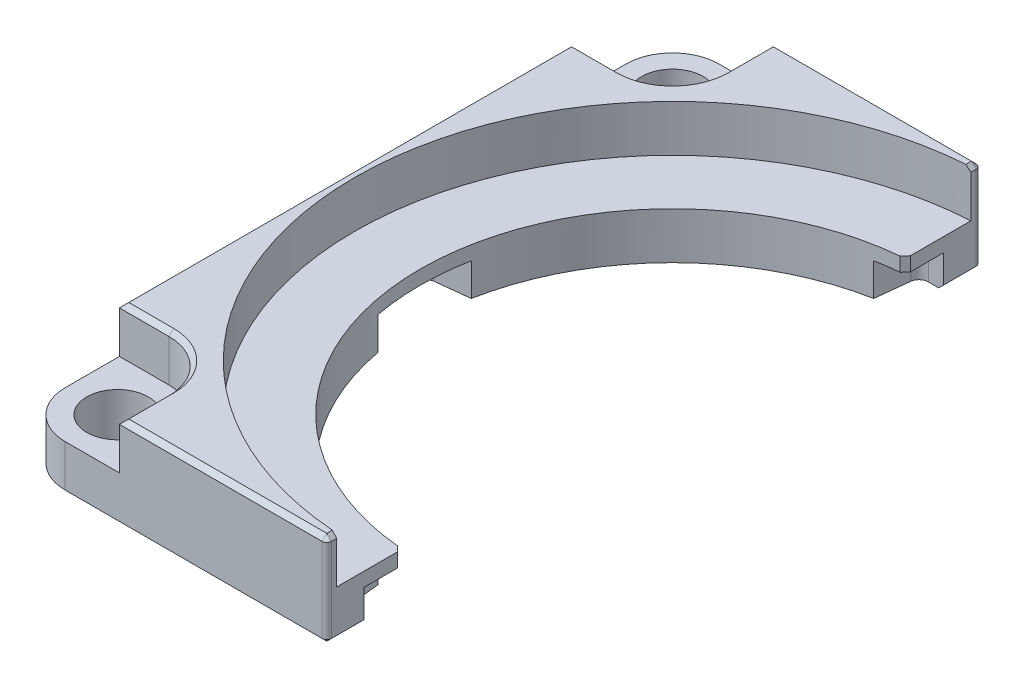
ISO-10303-21;
HEADER;
FILE_DESCRIPTION(('STEP AP214'),'2;1');
FILE_NAME('part.step','',(''),(''),'','','');
FILE_SCHEMA(('AUTOMOTIVE_DESIGN { 1 0 10303 214 1 1 1 1 }'));
ENDSEC;
DATA;
#1=APPLICATION_CONTEXT('core data for automotive mechanical design processes');
#2=APPLICATION_PROTOCOL_DEFINITION('international standard','automotive_design',2000,#1);
#3=PRODUCT_CONTEXT('',#1,'mechanical');
#4=PRODUCT('Part','Part','',(#3));
#5=PRODUCT_RELATED_PRODUCT_CATEGORY('part','',(#4));
#6=PRODUCT_DEFINITION_FORMATION('','',#4);
#7=PRODUCT_DEFINITION_CONTEXT('part definition',#1,'design');
#8=PRODUCT_DEFINITION('design','',#6,#7);
#9=PRODUCT_DEFINITION_SHAPE('','',#8);
#10=(LENGTH_UNIT() NAMED_UNIT(*) SI_UNIT(.MILLI.,.METRE.));
#11=(NAMED_UNIT(*) PLANE_ANGLE_UNIT() SI_UNIT($,.RADIAN.));
#12=(NAMED_UNIT(*) SI_UNIT($,.STERADIAN.) SOLID_ANGLE_UNIT());
#13=UNCERTAINTY_MEASURE_WITH_UNIT(LENGTH_MEASURE(1.E-05),#10,'distance_accuracy_value','');
#14=(GEOMETRIC_REPRESENTATION_CONTEXT(3) GLOBAL_UNCERTAINTY_ASSIGNED_CONTEXT((#13)) GLOBAL_UNIT_ASSIGNED_CONTEXT((#10,
#11,#12)) REPRESENTATION_CONTEXT('',''));
#15=CARTESIAN_POINT('',(0.,0.,0.));
#16=DIRECTION('',(0.,0.,1.));
#17=DIRECTION('',(1.,0.,0.));
#18=AXIS2_PLACEMENT_3D('',#15,#16,#17);
#19=CARTESIAN_POINT('',(-30.,10.,30.));
#20=DIRECTION('',(0.,-1.,0.));
#21=DIRECTION('',(0.,0.,-1.));
#22=AXIS2_PLACEMENT_3D('',#19,#20,#21);
#23=PLANE('',#22);
#24=CARTESIAN_POINT('',(0.,10.,0.));
#25=DIRECTION('',(0.,1.,0.));
#26=DIRECTION('',(0.,0.,1.));
#27=AXIS2_PLACEMENT_3D('',#24,#25,#26);
#28=CIRCLE('',#27,34.);
#29=CARTESIAN_POINT('',(-2.5,10.,-33.9079636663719));
#30=VERTEX_POINT('',#29);
#31=CARTESIAN_POINT('',(-2.5,10.,33.9079636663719));
#32=VERTEX_POINT('',#31);
#33=EDGE_CURVE('E345',#30,#32,#28,.T.);
#34=ORIENTED_EDGE('',*,*,#33,.F.);
#35=DIRECTION('',(0.,0.,-1.));
#36=VECTOR('',#35,1.);
#37=CARTESIAN_POINT('',(-2.5,10.,30.));
#38=LINE('',#37,#36);
#39=CARTESIAN_POINT('',(-2.5,10.,-34.5));
#40=VERTEX_POINT('',#39);
#41=EDGE_CURVE('E557',#30,#40,#38,.T.);
#42=ORIENTED_EDGE('',*,*,#41,.T.);
#43=DIRECTION('',(-1.,0.,0.));
#44=VECTOR('',#43,1.);
#45=CARTESIAN_POINT('',(-30.,10.,-34.5));
#46=LINE('',#45,#44);
#47=CARTESIAN_POINT('',(-23.7,10.,-34.5));
#48=VERTEX_POINT('',#47);
#49=EDGE_CURVE('E555',#40,#48,#46,.T.);
#50=ORIENTED_EDGE('',*,*,#49,.T.);
#51=DIRECTION('',(0.,0.,1.));
#52=VECTOR('',#51,1.);
#53=CARTESIAN_POINT('',(-23.7,10.,-29.7));
#54=LINE('',#53,#52);
#55=CARTESIAN_POINT('',(-23.7,10.,-29.7));
#56=VERTEX_POINT('',#55);
#57=EDGE_CURVE('E553',#48,#56,#54,.T.);
#58=ORIENTED_EDGE('',*,*,#57,.T.);
#59=CARTESIAN_POINT('',(-29.7,10.,-29.7));
#60=DIRECTION('',(0.,-1.,0.));
#61=DIRECTION('',(0.,0.,-1.));
#62=AXIS2_PLACEMENT_3D('',#59,#60,#61);
#63=CIRCLE('',#62,6.);
#64=CARTESIAN_POINT('',(-29.7,10.,-23.7));
#65=VERTEX_POINT('',#64);
#66=EDGE_CURVE('E551',#56,#65,#63,.T.);
#67=ORIENTED_EDGE('',*,*,#66,.T.);
#68=DIRECTION('',(-1.,0.,0.));
#69=VECTOR('',#68,1.);
#70=CARTESIAN_POINT('',(-35.,10.,-23.7));
#71=LINE('',#70,#69);
#72=CARTESIAN_POINT('',(-34.5,10.,-23.7));
#73=VERTEX_POINT('',#72);
#74=EDGE_CURVE('E549',#65,#73,#71,.T.);
#75=ORIENTED_EDGE('',*,*,#74,.T.);
#76=DIRECTION('',(0.,0.,1.));
#77=VECTOR('',#76,1.);
#78=CARTESIAN_POINT('',(-34.5,10.,30.));
#79=LINE('',#78,#77);
#80=CARTESIAN_POINT('',(-34.5,10.,23.7));
#81=VERTEX_POINT('',#80);
#82=EDGE_CURVE('E547',#73,#81,#79,.T.);
#83=ORIENTED_EDGE('',*,*,#82,.T.);
#84=DIRECTION('',(1.,0.,0.));
#85=VECTOR('',#84,1.);
#86=CARTESIAN_POINT('',(-29.7,10.,23.7));
#87=LINE('',#86,#85);
#88=CARTESIAN_POINT('',(-29.7,10.,23.7));
#89=VERTEX_POINT('',#88);
#90=EDGE_CURVE('E545',#81,#89,#87,.T.);
#91=ORIENTED_EDGE('',*,*,#90,.T.);
#92=CARTESIAN_POINT('',(-29.7,10.,29.7));
#93=DIRECTION('',(0.,-1.,0.));
#94=DIRECTION('',(0.,0.,-1.));
#95=AXIS2_PLACEMENT_3D('',#92,#93,#94);
#96=CIRCLE('',#95,6.);
#97=CARTESIAN_POINT('',(-23.7,10.,29.7));
#98=VERTEX_POINT('',#97);
#99=EDGE_CURVE('E543',#89,#98,#96,.T.);
#100=ORIENTED_EDGE('',*,*,#99,.T.);
#101=DIRECTION('',(0.,0.,1.));
#102=VECTOR('',#101,1.);
#103=CARTESIAN_POINT('',(-23.7,10.,35.));
#104=LINE('',#103,#102);
#105=CARTESIAN_POINT('',(-23.7,10.,34.5));
#106=VERTEX_POINT('',#105);
#107=EDGE_CURVE('E541',#98,#106,#104,.T.);
#108=ORIENTED_EDGE('',*,*,#107,.T.);
#109=DIRECTION('',(1.,0.,0.));
#110=VECTOR('',#109,1.);
#111=CARTESIAN_POINT('',(-30.,10.,34.5));
#112=LINE('',#111,#110);
#113=CARTESIAN_POINT('',(-2.5,10.,34.5));
#114=VERTEX_POINT('',#113);
#115=EDGE_CURVE('E537',#106,#114,#112,.T.);
#116=ORIENTED_EDGE('',*,*,#115,.T.);
#117=DIRECTION('',(0.,0.,-1.));
#118=VECTOR('',#117,1.);
#119=CARTESIAN_POINT('',(-2.5,10.,30.));
#120=LINE('',#119,#118);
#121=EDGE_CURVE('E539',#114,#32,#120,.T.);
#122=ORIENTED_EDGE('',*,*,#121,.T.);
#123=EDGE_LOOP('',(#34,#42,#50,#58,#67,#75,#83,#91,#100,#108,#116,#122));
#124=FACE_BOUND('',#123,.T.);
#125=ADVANCED_FACE('F17',(#124),#23,.F.);
#126=CARTESIAN_POINT('',(-2.,10.,35.));
#127=DIRECTION('',(-1.,0.,0.));
#128=DIRECTION('',(0.,0.,1.));
#129=AXIS2_PLACEMENT_3D('',#126,#127,#128);
#130=PLANE('',#129);
#131=DIRECTION('',(0.,0.,-1.));
#132=VECTOR('',#131,1.);
#133=CARTESIAN_POINT('',(-2.,3.5,35.));
#134=LINE('',#133,#132);
#135=CARTESIAN_POINT('',(-2.,3.5,31.));
#136=VERTEX_POINT('',#135);
#137=CARTESIAN_POINT('',(-2.,3.5,27.4258240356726));
#138=VERTEX_POINT('',#137);
#139=EDGE_CURVE('E500',#136,#138,#134,.T.);
#140=ORIENTED_EDGE('',*,*,#139,.T.);
#141=DIRECTION('',(0.,1.,0.));
#142=VECTOR('',#141,1.);
#143=CARTESIAN_POINT('',(-2.,10.,27.4258240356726));
#144=LINE('',#143,#142);
#145=CARTESIAN_POINT('',(-2.,5.,27.4258240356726));
#146=VERTEX_POINT('',#145);
#147=EDGE_CURVE('E603',#138,#146,#144,.T.);
#148=ORIENTED_EDGE('',*,*,#147,.T.);
#149=DIRECTION('',(0.,0.,-1.));
#150=VECTOR('',#149,1.);
#151=CARTESIAN_POINT('',(-2.,5.,26.9258240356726));
#152=LINE('',#151,#150);
#153=CARTESIAN_POINT('',(-2.,5.,33.9411254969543));
#154=VERTEX_POINT('',#153);
#155=EDGE_CURVE('E348',#154,#146,#152,.T.);
#156=ORIENTED_EDGE('',*,*,#155,.F.);
#157=DIRECTION('',(0.,-1.,0.));
#158=VECTOR('',#157,1.);
#159=CARTESIAN_POINT('',(-2.,10.,33.9411254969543));
#160=LINE('',#159,#158);
#161=CARTESIAN_POINT('',(-2.,9.5,33.9411254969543));
#162=VERTEX_POINT('',#161);
#163=EDGE_CURVE('E340',#162,#154,#160,.T.);
#164=ORIENTED_EDGE('',*,*,#163,.F.);
#165=DIRECTION('',(0.,0.,1.));
#166=VECTOR('',#165,1.);
#167=CARTESIAN_POINT('',(-2.,9.5,35.));
#168=LINE('',#167,#166);
#169=CARTESIAN_POINT('',(-2.,9.5,34.5));
#170=VERTEX_POINT('',#169);
#171=EDGE_CURVE('E601',#162,#170,#168,.T.);
#172=ORIENTED_EDGE('',*,*,#171,.T.);
#173=DIRECTION('',(0.,-1.,0.));
#174=VECTOR('',#173,1.);
#175=CARTESIAN_POINT('',(-2.,10.,34.5));
#176=LINE('',#175,#174);
#177=CARTESIAN_POINT('',(-2.,0.5,34.5));
#178=VERTEX_POINT('',#177);
#179=EDGE_CURVE('E523',#170,#178,#176,.T.);
#180=ORIENTED_EDGE('',*,*,#179,.T.);
#181=DIRECTION('',(0.,0.,-1.));
#182=VECTOR('',#181,1.);
#183=CARTESIAN_POINT('',(-2.,0.5,31.));
#184=LINE('',#183,#182);
#185=CARTESIAN_POINT('',(-2.,0.5,31.));
#186=VERTEX_POINT('',#185);
#187=EDGE_CURVE('E598',#178,#186,#184,.T.);
#188=ORIENTED_EDGE('',*,*,#187,.T.);
#189=DIRECTION('',(0.,-1.,0.));
#190=VECTOR('',#189,1.);
#191=CARTESIAN_POINT('',(-2.,10.,31.));
#192=LINE('',#191,#190);
#193=EDGE_CURVE('E450',#136,#186,#192,.T.);
#194=ORIENTED_EDGE('',*,*,#193,.F.);
#195=EDGE_LOOP('',(#140,#148,#156,#164,#172,#180,#188,#194));
#196=FACE_BOUND('',#195,.T.);
#197=ADVANCED_FACE('F771',(#196),#130,.F.);
#198=CARTESIAN_POINT('',(0.,10.,0.));
#199=DIRECTION('',(0.,-1.,0.));
#200=DIRECTION('',(0.,0.,-1.));
#201=AXIS2_PLACEMENT_3D('',#198,#199,#200);
#202=CYLINDRICAL_SURFACE('',#201,27.);
#203=CARTESIAN_POINT('',(0.,5.,0.));
#204=DIRECTION('',(0.,-1.,0.));
#205=DIRECTION('',(0.,0.,1.));
#206=AXIS2_PLACEMENT_3D('',#203,#204,#205);
#207=CIRCLE('',#206,27.);
#208=CARTESIAN_POINT('',(-2.54614498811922,5.,26.8796790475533));
#209=VERTEX_POINT('',#208);
#210=CARTESIAN_POINT('',(-2.50298176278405,5.,-26.8837326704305));
#211=VERTEX_POINT('',#210);
#212=EDGE_CURVE('E325',#209,#211,#207,.T.);
#213=ORIENTED_EDGE('',*,*,#212,.F.);
#214=DIRECTION('',(0.,-1.,0.));
#215=VECTOR('',#214,1.);
#216=CARTESIAN_POINT('',(-2.54614498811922,10.,26.8796790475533));
#217=LINE('',#216,#215);
#218=CARTESIAN_POINT('',(-2.54614498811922,3.5,26.8796790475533));
#219=VERTEX_POINT('',#218);
#220=EDGE_CURVE('E593',#209,#219,#217,.T.);
#221=ORIENTED_EDGE('',*,*,#220,.T.);
#222=CARTESIAN_POINT('',(0.,3.5,0.));
#223=DIRECTION('',(0.,-1.,0.));
#224=DIRECTION('',(0.,0.,1.));
#225=AXIS2_PLACEMENT_3D('',#222,#223,#224);
#226=CIRCLE('',#225,27.);
#227=CARTESIAN_POINT('',(-5.00000000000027,3.5,26.5329983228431));
#228=VERTEX_POINT('',#227);
#229=EDGE_CURVE('E473',#219,#228,#226,.T.);
#230=ORIENTED_EDGE('',*,*,#229,.T.);
#231=DIRECTION('',(0.,-1.,0.));
#232=VECTOR('',#231,1.);
#233=CARTESIAN_POINT('',(-5.00000000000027,3.5,26.5329983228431));
#234=LINE('',#233,#232);
#235=CARTESIAN_POINT('',(-5.00000000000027,0.,26.5329983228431));
#236=VERTEX_POINT('',#235);
#237=EDGE_CURVE('E465',#228,#236,#234,.T.);
#238=ORIENTED_EDGE('',*,*,#237,.T.);
#239=CARTESIAN_POINT('',(0.,0.,0.));
#240=DIRECTION('',(0.,-1.,0.));
#241=DIRECTION('',(0.,0.,1.));
#242=AXIS2_PLACEMENT_3D('',#239,#240,#241);
#243=CIRCLE('',#242,27.);
#244=CARTESIAN_POINT('',(-26.5329983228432,0.,5.));
#245=VERTEX_POINT('',#244);
#246=EDGE_CURVE('E506',#236,#245,#243,.T.);
#247=ORIENTED_EDGE('',*,*,#246,.T.);
#248=DIRECTION('',(0.,-1.,0.));
#249=VECTOR('',#248,1.);
#250=CARTESIAN_POINT('',(-26.5329983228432,3.5,5.));
#251=LINE('',#250,#249);
#252=CARTESIAN_POINT('',(-26.5329983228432,3.5,5.));
#253=VERTEX_POINT('',#252);
#254=EDGE_CURVE('E422',#253,#245,#251,.T.);
#255=ORIENTED_EDGE('',*,*,#254,.F.);
#256=CARTESIAN_POINT('',(0.,3.5,0.));
#257=DIRECTION('',(0.,-1.,0.));
#258=DIRECTION('',(0.,0.,1.));
#259=AXIS2_PLACEMENT_3D('',#256,#257,#258);
#260=CIRCLE('',#259,27.);
#261=CARTESIAN_POINT('',(-26.5329983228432,3.5,-5.));
#262=VERTEX_POINT('',#261);
#263=EDGE_CURVE('E408',#253,#262,#260,.T.);
#264=ORIENTED_EDGE('',*,*,#263,.T.);
#265=DIRECTION('',(0.,-1.,0.));
#266=VECTOR('',#265,1.);
#267=CARTESIAN_POINT('',(-26.5329983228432,3.5,-5.));
#268=LINE('',#267,#266);
#269=CARTESIAN_POINT('',(-26.5329983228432,0.,-5.));
#270=VERTEX_POINT('',#269);
#271=EDGE_CURVE('E447',#262,#270,#268,.T.);
#272=ORIENTED_EDGE('',*,*,#271,.T.);
#273=CARTESIAN_POINT('',(-4.99999999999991,0.,-26.5329983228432));
#274=VERTEX_POINT('',#273);
#275=EDGE_CURVE('E503',#270,#274,#243,.T.);
#276=ORIENTED_EDGE('',*,*,#275,.T.);
#277=DIRECTION('',(0.,-1.,0.));
#278=VECTOR('',#277,1.);
#279=CARTESIAN_POINT('',(-4.99999999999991,3.5,-26.5329983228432));
#280=LINE('',#279,#278);
#281=CARTESIAN_POINT('',(-4.99999999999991,3.5,-26.5329983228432));
#282=VERTEX_POINT('',#281);
#283=EDGE_CURVE('E461',#282,#274,#280,.T.);
#284=ORIENTED_EDGE('',*,*,#283,.F.);
#285=CARTESIAN_POINT('',(0.,3.5,0.));
#286=DIRECTION('',(0.,-1.,0.));
#287=DIRECTION('',(0.,0.,1.));
#288=AXIS2_PLACEMENT_3D('',#285,#286,#287);
#289=CIRCLE('',#288,27.);
#290=CARTESIAN_POINT('',(-2.50298176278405,3.5,-26.8837326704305));
#291=VERTEX_POINT('',#290);
#292=EDGE_CURVE('E451',#282,#291,#289,.T.);
#293=ORIENTED_EDGE('',*,*,#292,.T.);
#294=DIRECTION('',(0.,-1.,0.));
#295=VECTOR('',#294,1.);
#296=CARTESIAN_POINT('',(-2.50298176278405,10.,-26.8837326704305));
#297=LINE('',#296,#295);
#298=EDGE_CURVE('E591',#291,#211,#297,.F.);
#299=ORIENTED_EDGE('',*,*,#298,.T.);
#300=EDGE_LOOP('',(#213,#221,#230,#238,#247,#255,#264,#272,#276,#284,#293,#299));
#301=FACE_BOUND('',#300,.T.);
#302=ADVANCED_FACE('F724',(#301),#202,.F.);
#303=CARTESIAN_POINT('',(-2.,10.,-35.));
#304=DIRECTION('',(-1.,0.,0.));
#305=DIRECTION('',(0.,0.,1.));
#306=AXIS2_PLACEMENT_3D('',#303,#304,#305);
#307=PLANE('',#306);
#308=DIRECTION('',(0.,-1.,0.));
#309=VECTOR('',#308,1.);
#310=CARTESIAN_POINT('',(-2.,10.,-34.5));
#311=LINE('',#310,#309);
#312=CARTESIAN_POINT('',(-2.,0.5,-34.5));
#313=VERTEX_POINT('',#312);
#314=CARTESIAN_POINT('',(-2.,9.5,-34.5));
#315=VERTEX_POINT('',#314);
#316=EDGE_CURVE('E535',#313,#315,#311,.F.);
#317=ORIENTED_EDGE('',*,*,#316,.T.);
#318=DIRECTION('',(0.,0.,1.));
#319=VECTOR('',#318,1.);
#320=CARTESIAN_POINT('',(-2.,9.5,-35.));
#321=LINE('',#320,#319);
#322=CARTESIAN_POINT('',(-2.,9.5,-33.9411254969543));
#323=VERTEX_POINT('',#322);
#324=EDGE_CURVE('E332',#315,#323,#321,.T.);
#325=ORIENTED_EDGE('',*,*,#324,.T.);
#326=DIRECTION('',(0.,-1.,0.));
#327=VECTOR('',#326,1.);
#328=CARTESIAN_POINT('',(-2.,10.,-33.9411254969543));
#329=LINE('',#328,#327);
#330=CARTESIAN_POINT('',(-2.,5.,-33.9411254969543));
#331=VERTEX_POINT('',#330);
#332=EDGE_CURVE('E328',#323,#331,#329,.T.);
#333=ORIENTED_EDGE('',*,*,#332,.T.);
#334=DIRECTION('',(0.,0.,-1.));
#335=VECTOR('',#334,1.);
#336=CARTESIAN_POINT('',(-2.,5.,-26.9258240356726));
#337=LINE('',#336,#335);
#338=CARTESIAN_POINT('',(-2.,5.,-27.4674310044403));
#339=VERTEX_POINT('',#338);
#340=EDGE_CURVE('E312',#339,#331,#337,.T.);
#341=ORIENTED_EDGE('',*,*,#340,.F.);
#342=DIRECTION('',(0.,-1.,0.));
#343=VECTOR('',#342,1.);
#344=CARTESIAN_POINT('',(-2.,10.,-27.4674310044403));
#345=LINE('',#344,#343);
#346=CARTESIAN_POINT('',(-2.,3.5,-27.4674310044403));
#347=VERTEX_POINT('',#346);
#348=EDGE_CURVE('E562',#339,#347,#345,.T.);
#349=ORIENTED_EDGE('',*,*,#348,.T.);
#350=DIRECTION('',(0.,0.,-1.));
#351=VECTOR('',#350,1.);
#352=CARTESIAN_POINT('',(-2.,3.5,-35.));
#353=LINE('',#352,#351);
#354=CARTESIAN_POINT('',(-2.,3.5,-31.));
#355=VERTEX_POINT('',#354);
#356=EDGE_CURVE('E520',#347,#355,#353,.T.);
#357=ORIENTED_EDGE('',*,*,#356,.T.);
#358=DIRECTION('',(0.,1.,0.));
#359=VECTOR('',#358,1.);
#360=CARTESIAN_POINT('',(-2.,10.,-31.));
#361=LINE('',#360,#359);
#362=CARTESIAN_POINT('',(-2.,0.5,-31.));
#363=VERTEX_POINT('',#362);
#364=EDGE_CURVE('E498',#363,#355,#361,.T.);
#365=ORIENTED_EDGE('',*,*,#364,.F.);
#366=DIRECTION('',(0.,0.,-1.));
#367=VECTOR('',#366,1.);
#368=CARTESIAN_POINT('',(-2.,0.5,-34.5));
#369=LINE('',#368,#367);
#370=EDGE_CURVE('E560',#363,#313,#369,.T.);
#371=ORIENTED_EDGE('',*,*,#370,.T.);
#372=EDGE_LOOP('',(#317,#325,#333,#341,#349,#357,#365,#371));
#373=FACE_BOUND('',#372,.T.);
#374=ADVANCED_FACE('F330',(#373),#307,.F.);
#375=CARTESIAN_POINT('',(-2.,10.,35.));
#376=DIRECTION('',(0.,0.,-1.));
#377=DIRECTION('',(-1.,0.,0.));
#378=AXIS2_PLACEMENT_3D('',#375,#376,#377);
#379=PLANE('',#378);
#380=DIRECTION('',(0.,-1.,0.));
#381=VECTOR('',#380,1.);
#382=CARTESIAN_POINT('',(-30.,10.,35.));
#383=LINE('',#382,#381);
#384=CARTESIAN_POINT('',(-30.,5.,35.));
#385=VERTEX_POINT('',#384);
#386=CARTESIAN_POINT('',(-30.,0.5,35.));
#387=VERTEX_POINT('',#386);
#388=EDGE_CURVE('E507',#385,#387,#383,.T.);
#389=ORIENTED_EDGE('',*,*,#388,.T.);
#390=DIRECTION('',(1.,0.,0.));
#391=VECTOR('',#390,1.);
#392=CARTESIAN_POINT('',(-2.5,0.5,35.));
#393=LINE('',#392,#391);
#394=CARTESIAN_POINT('',(-2.5,0.5,35.));
#395=VERTEX_POINT('',#394);
#396=EDGE_CURVE('E11',#387,#395,#393,.T.);
#397=ORIENTED_EDGE('',*,*,#396,.T.);
#398=DIRECTION('',(0.,-1.,0.));
#399=VECTOR('',#398,1.);
#400=CARTESIAN_POINT('',(-2.5,10.,35.));
#401=LINE('',#400,#399);
#402=CARTESIAN_POINT('',(-2.5,9.5,35.));
#403=VERTEX_POINT('',#402);
#404=EDGE_CURVE('E530',#395,#403,#401,.F.);
#405=ORIENTED_EDGE('',*,*,#404,.T.);
#406=DIRECTION('',(-1.,0.,0.));
#407=VECTOR('',#406,1.);
#408=CARTESIAN_POINT('',(-2.,9.5,35.));
#409=LINE('',#408,#407);
#410=CARTESIAN_POINT('',(-24.2,9.5,35.));
#411=VERTEX_POINT('',#410);
#412=EDGE_CURVE('E27',#403,#411,#409,.T.);
#413=ORIENTED_EDGE('',*,*,#412,.T.);
#414=DIRECTION('',(0.,-1.,0.));
#415=VECTOR('',#414,1.);
#416=CARTESIAN_POINT('',(-24.2,10.,35.));
#417=LINE('',#416,#415);
#418=CARTESIAN_POINT('',(-24.2,5.,35.));
#419=VERTEX_POINT('',#418);
#420=EDGE_CURVE('E395',#411,#419,#417,.T.);
#421=ORIENTED_EDGE('',*,*,#420,.T.);
#422=DIRECTION('',(1.,0.,0.));
#423=VECTOR('',#422,1.);
#424=CARTESIAN_POINT('',(-24.2,5.,35.));
#425=LINE('',#424,#423);
#426=EDGE_CURVE('E387',#385,#419,#425,.T.);
#427=ORIENTED_EDGE('',*,*,#426,.F.);
#428=EDGE_LOOP('',(#389,#397,#405,#413,#421,#427));
#429=FACE_BOUND('',#428,.T.);
#430=ADVANCED_FACE('F878',(#429),#379,.F.);
#431=CARTESIAN_POINT('',(-2.,10.,-35.));
#432=DIRECTION('',(0.,0.,1.));
#433=DIRECTION('',(1.,0.,0.));
#434=AXIS2_PLACEMENT_3D('',#431,#432,#433);
#435=PLANE('',#434);
#436=DIRECTION('',(0.,-1.,0.));
#437=VECTOR('',#436,1.);
#438=CARTESIAN_POINT('',(-24.2,10.,-35.));
#439=LINE('',#438,#437);
#440=CARTESIAN_POINT('',(-24.2,9.5,-35.));
#441=VERTEX_POINT('',#440);
#442=CARTESIAN_POINT('',(-24.2,5.,-35.));
#443=VERTEX_POINT('',#442);
#444=EDGE_CURVE('E369',#441,#443,#439,.T.);
#445=ORIENTED_EDGE('',*,*,#444,.F.);
#446=DIRECTION('',(1.,0.,0.));
#447=VECTOR('',#446,1.);
#448=CARTESIAN_POINT('',(-2.,9.5,-35.));
#449=LINE('',#448,#447);
#450=CARTESIAN_POINT('',(-2.5,9.5,-35.));
#451=VERTEX_POINT('',#450);
#452=EDGE_CURVE('E577',#441,#451,#449,.T.);
#453=ORIENTED_EDGE('',*,*,#452,.T.);
#454=DIRECTION('',(0.,-1.,0.));
#455=VECTOR('',#454,1.);
#456=CARTESIAN_POINT('',(-2.5,10.,-35.));
#457=LINE('',#456,#455);
#458=CARTESIAN_POINT('',(-2.5,0.5,-35.));
#459=VERTEX_POINT('',#458);
#460=EDGE_CURVE('E532',#451,#459,#457,.T.);
#461=ORIENTED_EDGE('',*,*,#460,.T.);
#462=DIRECTION('',(-1.,0.,0.));
#463=VECTOR('',#462,1.);
#464=CARTESIAN_POINT('',(-30.,0.5,-35.));
#465=LINE('',#464,#463);
#466=CARTESIAN_POINT('',(-30.,0.5,-35.));
#467=VERTEX_POINT('',#466);
#468=EDGE_CURVE('E575',#459,#467,#465,.T.);
#469=ORIENTED_EDGE('',*,*,#468,.T.);
#470=DIRECTION('',(0.,-1.,0.));
#471=VECTOR('',#470,1.);
#472=CARTESIAN_POINT('',(-30.,10.,-35.));
#473=LINE('',#472,#471);
#474=CARTESIAN_POINT('',(-30.,5.,-35.));
#475=VERTEX_POINT('',#474);
#476=EDGE_CURVE('E515',#475,#467,#473,.T.);
#477=ORIENTED_EDGE('',*,*,#476,.F.);
#478=DIRECTION('',(-1.,0.,0.));
#479=VECTOR('',#478,1.);
#480=CARTESIAN_POINT('',(-24.2,5.,-35.));
#481=LINE('',#480,#479);
#482=EDGE_CURVE('E367',#443,#475,#481,.T.);
#483=ORIENTED_EDGE('',*,*,#482,.F.);
#484=EDGE_LOOP('',(#445,#453,#461,#469,#477,#483));
#485=FACE_BOUND('',#484,.T.);
#486=ADVANCED_FACE('F802',(#485),#435,.F.);
#487=CARTESIAN_POINT('',(-30.,10.,-30.));
#488=DIRECTION('',(0.,-1.,0.));
#489=DIRECTION('',(0.,0.,-1.));
#490=AXIS2_PLACEMENT_3D('',#487,#488,#489);
#491=CYLINDRICAL_SURFACE('',#490,5.);
#492=ORIENTED_EDGE('',*,*,#476,.T.);
#493=CARTESIAN_POINT('',(-30.,0.5,-30.));
#494=DIRECTION('',(0.,-1.,0.));
#495=DIRECTION('',(0.,0.,-1.));
#496=AXIS2_PLACEMENT_3D('',#493,#494,#495);
#497=CIRCLE('',#496,5.);
#498=CARTESIAN_POINT('',(-35.,0.5,-30.));
#499=VERTEX_POINT('',#498);
#500=EDGE_CURVE('E631',#467,#499,#497,.F.);
#501=ORIENTED_EDGE('',*,*,#500,.T.);
#502=DIRECTION('',(0.,-1.,0.));
#503=VECTOR('',#502,1.);
#504=CARTESIAN_POINT('',(-35.,10.,-30.));
#505=LINE('',#504,#503);
#506=CARTESIAN_POINT('',(-35.,5.,-30.));
#507=VERTEX_POINT('',#506);
#508=EDGE_CURVE('E512',#507,#499,#505,.T.);
#509=ORIENTED_EDGE('',*,*,#508,.F.);
#510=CARTESIAN_POINT('',(-30.,5.,-30.));
#511=DIRECTION('',(0.,1.,0.));
#512=DIRECTION('',(0.,0.,1.));
#513=AXIS2_PLACEMENT_3D('',#510,#511,#512);
#514=CIRCLE('',#513,5.);
#515=EDGE_CURVE('E352',#475,#507,#514,.T.);
#516=ORIENTED_EDGE('',*,*,#515,.F.);
#517=EDGE_LOOP('',(#492,#501,#509,#516));
#518=FACE_BOUND('',#517,.T.);
#519=ADVANCED_FACE('F807',(#518),#491,.T.);
#520=CARTESIAN_POINT('',(-35.,10.,-30.));
#521=DIRECTION('',(1.,0.,0.));
#522=DIRECTION('',(0.,0.,-1.));
#523=AXIS2_PLACEMENT_3D('',#520,#521,#522);
#524=PLANE('',#523);
#525=DIRECTION('',(0.,-1.,0.));
#526=VECTOR('',#525,1.);
#527=CARTESIAN_POINT('',(-35.,10.,24.2));
#528=LINE('',#527,#526);
#529=CARTESIAN_POINT('',(-35.,9.5,24.2));
#530=VERTEX_POINT('',#529);
#531=CARTESIAN_POINT('',(-35.,5.,24.2));
#532=VERTEX_POINT('',#531);
#533=EDGE_CURVE('E397',#530,#532,#528,.T.);
#534=ORIENTED_EDGE('',*,*,#533,.F.);
#535=DIRECTION('',(0.,0.,-1.));
#536=VECTOR('',#535,1.);
#537=CARTESIAN_POINT('',(-35.,9.5,-30.));
#538=LINE('',#537,#536);
#539=CARTESIAN_POINT('',(-35.,9.5,-24.2));
#540=VERTEX_POINT('',#539);
#541=EDGE_CURVE('E589',#530,#540,#538,.T.);
#542=ORIENTED_EDGE('',*,*,#541,.T.);
#543=DIRECTION('',(0.,-1.,0.));
#544=VECTOR('',#543,1.);
#545=CARTESIAN_POINT('',(-35.,10.,-24.2));
#546=LINE('',#545,#544);
#547=CARTESIAN_POINT('',(-35.,5.,-24.2));
#548=VERTEX_POINT('',#547);
#549=EDGE_CURVE('E375',#540,#548,#546,.T.);
#550=ORIENTED_EDGE('',*,*,#549,.T.);
#551=DIRECTION('',(0.,0.,1.));
#552=VECTOR('',#551,1.);
#553=CARTESIAN_POINT('',(-35.,5.,-30.));
#554=LINE('',#553,#552);
#555=EDGE_CURVE('E354',#507,#548,#554,.T.);
#556=ORIENTED_EDGE('',*,*,#555,.F.);
#557=ORIENTED_EDGE('',*,*,#508,.T.);
#558=DIRECTION('',(0.,0.,1.));
#559=VECTOR('',#558,1.);
#560=CARTESIAN_POINT('',(-35.,0.5,30.));
#561=LINE('',#560,#559);
#562=CARTESIAN_POINT('',(-35.,0.5,30.));
#563=VERTEX_POINT('',#562);
#564=EDGE_CURVE('E587',#499,#563,#561,.T.);
#565=ORIENTED_EDGE('',*,*,#564,.T.);
#566=DIRECTION('',(0.,-1.,0.));
#567=VECTOR('',#566,1.);
#568=CARTESIAN_POINT('',(-35.,10.,30.));
#569=LINE('',#568,#567);
#570=CARTESIAN_POINT('',(-35.,5.,30.));
#571=VERTEX_POINT('',#570);
#572=EDGE_CURVE('E509',#571,#563,#569,.T.);
#573=ORIENTED_EDGE('',*,*,#572,.F.);
#574=DIRECTION('',(0.,0.,1.));
#575=VECTOR('',#574,1.);
#576=CARTESIAN_POINT('',(-35.,5.,30.));
#577=LINE('',#576,#575);
#578=EDGE_CURVE('E383',#532,#571,#577,.T.);
#579=ORIENTED_EDGE('',*,*,#578,.F.);
#580=EDGE_LOOP('',(#534,#542,#550,#556,#557,#565,#573,#579));
#581=FACE_BOUND('',#580,.T.);
#582=ADVANCED_FACE('F816',(#581),#524,.F.);
#583=CARTESIAN_POINT('',(-29.7,10.,-29.7));
#584=DIRECTION('',(0.,1.,0.));
#585=DIRECTION('',(0.,0.,1.));
#586=AXIS2_PLACEMENT_3D('',#583,#584,#585);
#587=CYLINDRICAL_SURFACE('',#586,3.3);
#588=CARTESIAN_POINT('',(-29.7,0.,-29.7));
#589=DIRECTION('',(0.,1.,0.));
#590=DIRECTION('',(0.,0.,1.));
#591=AXIS2_PLACEMENT_3D('',#588,#589,#590);
#592=CIRCLE('',#591,3.3);
#593=CARTESIAN_POINT('',(-29.7,0.,-26.4));
#594=VERTEX_POINT('',#593);
#595=EDGE_CURVE('E400',#594,#594,#592,.T.);
#596=ORIENTED_EDGE('',*,*,#595,.F.);
#597=EDGE_LOOP('',(#596));
#598=FACE_BOUND('',#597,.T.);
#599=CARTESIAN_POINT('',(-29.7,5.,-29.7));
#600=DIRECTION('',(0.,1.,0.));
#601=DIRECTION('',(0.,0.,1.));
#602=AXIS2_PLACEMENT_3D('',#599,#600,#601);
#603=CIRCLE('',#602,3.3);
#604=CARTESIAN_POINT('',(-29.7,5.,-26.4));
#605=VERTEX_POINT('',#604);
#606=EDGE_CURVE('E377',#605,#605,#603,.F.);
#607=ORIENTED_EDGE('',*,*,#606,.F.);
#608=EDGE_LOOP('',(#607));
#609=FACE_BOUND('',#608,.T.);
#610=ADVANCED_FACE('F915',(#598,#609),#587,.F.);
#611=CARTESIAN_POINT('',(-30.,0.,30.));
#612=DIRECTION('',(0.,-1.,0.));
#613=DIRECTION('',(0.,0.,-1.));
#614=AXIS2_PLACEMENT_3D('',#611,#612,#613);
#615=PLANE('',#614);
#616=DIRECTION('',(1.,0.,0.));
#617=VECTOR('',#616,1.);
#618=CARTESIAN_POINT('',(-3.60568702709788,0.,31.));
#619=LINE('',#618,#617);
#620=CARTESIAN_POINT('',(-3.60568702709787,0.,31.));
#621=VERTEX_POINT('',#620);
#622=CARTESIAN_POINT('',(-2.5,0.,31.));
#623=VERTEX_POINT('',#622);
#624=EDGE_CURVE('E476',#621,#623,#619,.T.);
#625=ORIENTED_EDGE('',*,*,#624,.T.);
#626=DIRECTION('',(0.,0.,1.));
#627=VECTOR('',#626,1.);
#628=CARTESIAN_POINT('',(-2.5,0.,34.5));
#629=LINE('',#628,#627);
#630=CARTESIAN_POINT('',(-2.5,0.,34.5));
#631=VERTEX_POINT('',#630);
#632=EDGE_CURVE('E627',#623,#631,#629,.T.);
#633=ORIENTED_EDGE('',*,*,#632,.T.);
#634=DIRECTION('',(-1.,0.,0.));
#635=VECTOR('',#634,1.);
#636=CARTESIAN_POINT('',(-30.,0.,34.5));
#637=LINE('',#636,#635);
#638=CARTESIAN_POINT('',(-30.,0.,34.5));
#639=VERTEX_POINT('',#638);
#640=EDGE_CURVE('E615',#631,#639,#637,.T.);
#641=ORIENTED_EDGE('',*,*,#640,.T.);
#642=CARTESIAN_POINT('',(-30.,0.,30.));
#643=DIRECTION('',(0.,-1.,0.));
#644=DIRECTION('',(0.,0.,-1.));
#645=AXIS2_PLACEMENT_3D('',#642,#643,#644);
#646=CIRCLE('',#645,4.5);
#647=CARTESIAN_POINT('',(-34.5,0.,30.));
#648=VERTEX_POINT('',#647);
#649=EDGE_CURVE('E617',#639,#648,#646,.T.);
#650=ORIENTED_EDGE('',*,*,#649,.T.);
#651=DIRECTION('',(0.,0.,-1.));
#652=VECTOR('',#651,1.);
#653=CARTESIAN_POINT('',(-34.5,0.,-30.));
#654=LINE('',#653,#652);
#655=CARTESIAN_POINT('',(-34.5,0.,-30.));
#656=VERTEX_POINT('',#655);
#657=EDGE_CURVE('E619',#648,#656,#654,.T.);
#658=ORIENTED_EDGE('',*,*,#657,.T.);
#659=CARTESIAN_POINT('',(-30.,0.,-30.));
#660=DIRECTION('',(0.,-1.,0.));
#661=DIRECTION('',(0.,0.,-1.));
#662=AXIS2_PLACEMENT_3D('',#659,#660,#661);
#663=CIRCLE('',#662,4.5);
#664=CARTESIAN_POINT('',(-30.,0.,-34.5));
#665=VERTEX_POINT('',#664);
#666=EDGE_CURVE('E621',#656,#665,#663,.T.);
#667=ORIENTED_EDGE('',*,*,#666,.T.);
#668=DIRECTION('',(1.,0.,0.));
#669=VECTOR('',#668,1.);
#670=CARTESIAN_POINT('',(-2.5,0.,-34.5));
#671=LINE('',#670,#669);
#672=CARTESIAN_POINT('',(-2.5,0.,-34.5));
#673=VERTEX_POINT('',#672);
#674=EDGE_CURVE('E623',#665,#673,#671,.T.);
#675=ORIENTED_EDGE('',*,*,#674,.T.);
#676=DIRECTION('',(0.,0.,1.));
#677=VECTOR('',#676,1.);
#678=CARTESIAN_POINT('',(-2.5,0.,-31.));
#679=LINE('',#678,#677);
#680=CARTESIAN_POINT('',(-2.5,0.,-31.));
#681=VERTEX_POINT('',#680);
#682=EDGE_CURVE('E625',#673,#681,#679,.T.);
#683=ORIENTED_EDGE('',*,*,#682,.T.);
#684=DIRECTION('',(-1.,0.,0.));
#685=VECTOR('',#684,1.);
#686=CARTESIAN_POINT('',(-30.,0.,-31.));
#687=LINE('',#686,#685);
#688=CARTESIAN_POINT('',(-3.60568702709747,0.,-31.));
#689=VERTEX_POINT('',#688);
#690=EDGE_CURVE('E518',#681,#689,#687,.T.);
#691=ORIENTED_EDGE('',*,*,#690,.T.);
#692=CARTESIAN_POINT('',(-3.60568702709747,0.,-30.));
#693=DIRECTION('',(0.,1.,0.));
#694=DIRECTION('',(0.,0.,-1.));
#695=AXIS2_PLACEMENT_3D('',#692,#693,#694);
#696=CIRCLE('',#695,1.);
#697=CARTESIAN_POINT('',(-4.5994809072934,0.,-30.1112372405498));
#698=VERTEX_POINT('',#697);
#699=EDGE_CURVE('E462',#689,#698,#696,.T.);
#700=ORIENTED_EDGE('',*,*,#699,.T.);
#701=DIRECTION('',(-0.111237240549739,0.,0.993793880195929));
#702=VECTOR('',#701,1.);
#703=CARTESIAN_POINT('',(-4.99999999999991,0.,-26.5329983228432));
#704=LINE('',#703,#702);
#705=EDGE_CURVE('E455',#698,#274,#704,.T.);
#706=ORIENTED_EDGE('',*,*,#705,.T.);
#707=ORIENTED_EDGE('',*,*,#275,.F.);
#708=DIRECTION('',(-0.993793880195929,0.,0.111237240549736));
#709=VECTOR('',#708,1.);
#710=CARTESIAN_POINT('',(-26.5329983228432,0.,-5.));
#711=LINE('',#710,#709);
#712=CARTESIAN_POINT('',(-30.1112372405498,0.,-4.59948090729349));
#713=VERTEX_POINT('',#712);
#714=EDGE_CURVE('E423',#270,#713,#711,.T.);
#715=ORIENTED_EDGE('',*,*,#714,.T.);
#716=CARTESIAN_POINT('',(-30.,0.,-3.60568702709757));
#717=DIRECTION('',(0.,1.,0.));
#718=DIRECTION('',(0.,0.,1.));
#719=AXIS2_PLACEMENT_3D('',#716,#717,#718);
#720=CIRCLE('',#719,1.);
#721=CARTESIAN_POINT('',(-31.,0.,-3.60568702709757));
#722=VERTEX_POINT('',#721);
#723=EDGE_CURVE('E426',#713,#722,#720,.T.);
#724=ORIENTED_EDGE('',*,*,#723,.T.);
#725=DIRECTION('',(0.,0.,1.));
#726=VECTOR('',#725,1.);
#727=CARTESIAN_POINT('',(-31.,0.,-3.60568702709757));
#728=LINE('',#727,#726);
#729=CARTESIAN_POINT('',(-31.,0.,3.60568702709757));
#730=VERTEX_POINT('',#729);
#731=EDGE_CURVE('E430',#722,#730,#728,.T.);
#732=ORIENTED_EDGE('',*,*,#731,.T.);
#733=CARTESIAN_POINT('',(-30.,0.,3.60568702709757));
#734=DIRECTION('',(0.,1.,0.));
#735=DIRECTION('',(0.,0.,-1.));
#736=AXIS2_PLACEMENT_3D('',#733,#734,#735);
#737=CIRCLE('',#736,1.);
#738=CARTESIAN_POINT('',(-30.1112372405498,0.,4.5994809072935));
#739=VERTEX_POINT('',#738);
#740=EDGE_CURVE('E433',#730,#739,#737,.T.);
#741=ORIENTED_EDGE('',*,*,#740,.T.);
#742=DIRECTION('',(0.993793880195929,0.,0.111237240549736));
#743=VECTOR('',#742,1.);
#744=CARTESIAN_POINT('',(-26.5329983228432,0.,5.));
#745=LINE('',#744,#743);
#746=EDGE_CURVE('E412',#739,#245,#745,.T.);
#747=ORIENTED_EDGE('',*,*,#746,.T.);
#748=ORIENTED_EDGE('',*,*,#246,.F.);
#749=DIRECTION('',(0.111237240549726,0.,0.99379388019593));
#750=VECTOR('',#749,1.);
#751=CARTESIAN_POINT('',(-5.00000000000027,0.,26.5329983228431));
#752=LINE('',#751,#750);
#753=CARTESIAN_POINT('',(-4.5994809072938,0.,30.1112372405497));
#754=VERTEX_POINT('',#753);
#755=EDGE_CURVE('E407',#236,#754,#752,.T.);
#756=ORIENTED_EDGE('',*,*,#755,.T.);
#757=CARTESIAN_POINT('',(-3.60568702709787,0.,30.));
#758=DIRECTION('',(0.,1.,0.));
#759=DIRECTION('',(0.,0.,1.));
#760=AXIS2_PLACEMENT_3D('',#757,#758,#759);
#761=CIRCLE('',#760,1.);
#762=EDGE_CURVE('E486',#754,#621,#761,.T.);
#763=ORIENTED_EDGE('',*,*,#762,.T.);
#764=EDGE_LOOP('',(#625,#633,#641,#650,#658,#667,#675,#683,#691,#700,#706,#707,#715,#724,#732,
#741,#747,#748,#756,#763));
#765=FACE_BOUND('',#764,.T.);
#766=ORIENTED_EDGE('',*,*,#595,.T.);
#767=EDGE_LOOP('',(#766));
#768=FACE_BOUND('',#767,.T.);
#769=CARTESIAN_POINT('',(-29.7,0.,29.7));
#770=DIRECTION('',(0.,1.,0.));
#771=DIRECTION('',(0.,0.,1.));
#772=AXIS2_PLACEMENT_3D('',#769,#770,#771);
#773=CIRCLE('',#772,3.3);
#774=CARTESIAN_POINT('',(-29.7,0.,33.));
#775=VERTEX_POINT('',#774);
#776=EDGE_CURVE('E403',#775,#775,#773,.T.);
#777=ORIENTED_EDGE('',*,*,#776,.T.);
#778=EDGE_LOOP('',(#777));
#779=FACE_BOUND('',#778,.T.);
#780=ADVANCED_FACE('F707',(#765,#768,#779),#615,.T.);
#781=CARTESIAN_POINT('',(-30.,10.,30.));
#782=DIRECTION('',(0.,-1.,0.));
#783=DIRECTION('',(0.,0.,-1.));
#784=AXIS2_PLACEMENT_3D('',#781,#782,#783);
#785=CYLINDRICAL_SURFACE('',#784,5.);
#786=ORIENTED_EDGE('',*,*,#572,.T.);
#787=CARTESIAN_POINT('',(-30.,0.5,30.));
#788=DIRECTION('',(0.,-1.,0.));
#789=DIRECTION('',(0.,0.,-1.));
#790=AXIS2_PLACEMENT_3D('',#787,#788,#789);
#791=CIRCLE('',#790,5.);
#792=EDGE_CURVE('E633',#563,#387,#791,.F.);
#793=ORIENTED_EDGE('',*,*,#792,.T.);
#794=ORIENTED_EDGE('',*,*,#388,.F.);
#795=CARTESIAN_POINT('',(-30.,5.,30.));
#796=DIRECTION('',(0.,1.,0.));
#797=DIRECTION('',(0.,0.,-1.));
#798=AXIS2_PLACEMENT_3D('',#795,#796,#797);
#799=CIRCLE('',#798,5.);
#800=EDGE_CURVE('E385',#571,#385,#799,.T.);
#801=ORIENTED_EDGE('',*,*,#800,.F.);
#802=EDGE_LOOP('',(#786,#793,#794,#801));
#803=FACE_BOUND('',#802,.T.);
#804=ADVANCED_FACE('F902',(#803),#785,.T.);
#805=CARTESIAN_POINT('',(0.,3.5,0.));
#806=DIRECTION('',(0.,1.,0.));
#807=DIRECTION('',(0.,0.,1.));
#808=AXIS2_PLACEMENT_3D('',#805,#806,#807);
#809=PLANE('',#808);
#810=ORIENTED_EDGE('',*,*,#229,.F.);
#811=DIRECTION('',(-0.707106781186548,0.,-0.707106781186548));
#812=VECTOR('',#811,1.);
#813=CARTESIAN_POINT('',(-2.54614498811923,3.5,26.8796790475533));
#814=LINE('',#813,#812);
#815=EDGE_CURVE('E596',#219,#138,#814,.F.);
#816=ORIENTED_EDGE('',*,*,#815,.T.);
#817=ORIENTED_EDGE('',*,*,#139,.F.);
#818=DIRECTION('',(1.,0.,0.));
#819=VECTOR('',#818,1.);
#820=CARTESIAN_POINT('',(-3.60568702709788,3.5,31.));
#821=LINE('',#820,#819);
#822=CARTESIAN_POINT('',(-3.60568702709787,3.5,31.));
#823=VERTEX_POINT('',#822);
#824=EDGE_CURVE('E480',#823,#136,#821,.T.);
#825=ORIENTED_EDGE('',*,*,#824,.F.);
#826=CARTESIAN_POINT('',(-3.60568702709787,3.5,30.));
#827=DIRECTION('',(0.,1.,0.));
#828=DIRECTION('',(0.,0.,1.));
#829=AXIS2_PLACEMENT_3D('',#826,#827,#828);
#830=CIRCLE('',#829,1.);
#831=CARTESIAN_POINT('',(-4.5994809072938,3.5,30.1112372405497));
#832=VERTEX_POINT('',#831);
#833=EDGE_CURVE('E478',#832,#823,#830,.T.);
#834=ORIENTED_EDGE('',*,*,#833,.F.);
#835=DIRECTION('',(0.111237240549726,0.,0.99379388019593));
#836=VECTOR('',#835,1.);
#837=CARTESIAN_POINT('',(-5.00000000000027,3.5,26.5329983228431));
#838=LINE('',#837,#836);
#839=EDGE_CURVE('E475',#228,#832,#838,.T.);
#840=ORIENTED_EDGE('',*,*,#839,.F.);
#841=EDGE_LOOP('',(#810,#816,#817,#825,#834,#840));
#842=FACE_BOUND('',#841,.T.);
#843=ADVANCED_FACE('F905',(#842),#809,.F.);
#844=CARTESIAN_POINT('',(-3.60568702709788,3.5,31.));
#845=DIRECTION('',(0.,0.,-1.));
#846=DIRECTION('',(-1.,0.,0.));
#847=AXIS2_PLACEMENT_3D('',#844,#845,#846);
#848=PLANE('',#847);
#849=ORIENTED_EDGE('',*,*,#193,.T.);
#850=DIRECTION('',(-0.707106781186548,-0.707106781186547,0.));
#851=VECTOR('',#850,1.);
#852=CARTESIAN_POINT('',(-1.30284351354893,1.19715648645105,31.));
#853=LINE('',#852,#851);
#854=EDGE_CURVE('E613',#186,#623,#853,.T.);
#855=ORIENTED_EDGE('',*,*,#854,.T.);
#856=ORIENTED_EDGE('',*,*,#624,.F.);
#857=DIRECTION('',(0.,-1.,0.));
#858=VECTOR('',#857,1.);
#859=CARTESIAN_POINT('',(-3.60568702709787,3.5,31.));
#860=LINE('',#859,#858);
#861=EDGE_CURVE('E483',#823,#621,#860,.T.);
#862=ORIENTED_EDGE('',*,*,#861,.F.);
#863=ORIENTED_EDGE('',*,*,#824,.T.);
#864=EDGE_LOOP('',(#849,#855,#856,#862,#863));
#865=FACE_BOUND('',#864,.T.);
#866=ADVANCED_FACE('F765',(#865),#848,.T.);
#867=CARTESIAN_POINT('',(-5.00000000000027,3.5,26.5329983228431));
#868=DIRECTION('',(0.99379388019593,0.,-0.111237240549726));
#869=DIRECTION('',(-0.111237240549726,0.,-0.99379388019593));
#870=AXIS2_PLACEMENT_3D('',#867,#868,#869);
#871=PLANE('',#870);
#872=ORIENTED_EDGE('',*,*,#755,.F.);
#873=ORIENTED_EDGE('',*,*,#237,.F.);
#874=ORIENTED_EDGE('',*,*,#839,.T.);
#875=DIRECTION('',(0.,-1.,0.));
#876=VECTOR('',#875,1.);
#877=CARTESIAN_POINT('',(-4.5994809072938,3.5,30.1112372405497));
#878=LINE('',#877,#876);
#879=EDGE_CURVE('E492',#832,#754,#878,.T.);
#880=ORIENTED_EDGE('',*,*,#879,.T.);
#881=EDGE_LOOP('',(#872,#873,#874,#880));
#882=FACE_BOUND('',#881,.T.);
#883=ADVANCED_FACE('F754',(#882),#871,.T.);
#884=CARTESIAN_POINT('',(-3.60568702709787,3.5,30.));
#885=DIRECTION('',(0.,-1.,0.));
#886=DIRECTION('',(0.,0.,-1.));
#887=AXIS2_PLACEMENT_3D('',#884,#885,#886);
#888=CYLINDRICAL_SURFACE('',#887,1.);
#889=ORIENTED_EDGE('',*,*,#762,.F.);
#890=ORIENTED_EDGE('',*,*,#879,.F.);
#891=ORIENTED_EDGE('',*,*,#833,.T.);
#892=ORIENTED_EDGE('',*,*,#861,.T.);
#893=EDGE_LOOP('',(#889,#890,#891,#892));
#894=FACE_BOUND('',#893,.T.);
#895=ADVANCED_FACE('F760',(#894),#888,.F.);
#896=CARTESIAN_POINT('',(0.,3.5,0.));
#897=DIRECTION('',(0.,1.,0.));
#898=DIRECTION('',(0.,0.,1.));
#899=AXIS2_PLACEMENT_3D('',#896,#897,#898);
#900=PLANE('',#899);
#901=ORIENTED_EDGE('',*,*,#356,.F.);
#902=DIRECTION('',(0.652785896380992,0.,-0.75754245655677));
#903=VECTOR('',#902,1.);
#904=CARTESIAN_POINT('',(-2.,3.5,-27.4674310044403));
#905=LINE('',#904,#903);
#906=EDGE_CURVE('E608',#347,#291,#905,.F.);
#907=ORIENTED_EDGE('',*,*,#906,.T.);
#908=ORIENTED_EDGE('',*,*,#292,.F.);
#909=DIRECTION('',(-0.111237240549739,0.,0.993793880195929));
#910=VECTOR('',#909,1.);
#911=CARTESIAN_POINT('',(-4.99999999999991,3.5,-26.5329983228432));
#912=LINE('',#911,#910);
#913=CARTESIAN_POINT('',(-4.5994809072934,3.5,-30.1112372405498));
#914=VERTEX_POINT('',#913);
#915=EDGE_CURVE('E459',#914,#282,#912,.T.);
#916=ORIENTED_EDGE('',*,*,#915,.F.);
#917=CARTESIAN_POINT('',(-3.60568702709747,3.5,-30.));
#918=DIRECTION('',(0.,1.,0.));
#919=DIRECTION('',(0.,0.,-1.));
#920=AXIS2_PLACEMENT_3D('',#917,#918,#919);
#921=CIRCLE('',#920,1.);
#922=CARTESIAN_POINT('',(-3.60568702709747,3.5,-31.));
#923=VERTEX_POINT('',#922);
#924=EDGE_CURVE('E457',#923,#914,#921,.T.);
#925=ORIENTED_EDGE('',*,*,#924,.F.);
#926=DIRECTION('',(-1.,0.,0.));
#927=VECTOR('',#926,1.);
#928=CARTESIAN_POINT('',(3.60568702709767,3.5,-31.));
#929=LINE('',#928,#927);
#930=EDGE_CURVE('E454',#355,#923,#929,.T.);
#931=ORIENTED_EDGE('',*,*,#930,.F.);
#932=EDGE_LOOP('',(#901,#907,#908,#916,#925,#931));
#933=FACE_BOUND('',#932,.T.);
#934=ADVANCED_FACE('F930',(#933),#900,.F.);
#935=CARTESIAN_POINT('',(3.60568702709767,3.5,-31.));
#936=DIRECTION('',(0.,0.,1.));
#937=DIRECTION('',(1.,0.,0.));
#938=AXIS2_PLACEMENT_3D('',#935,#936,#937);
#939=PLANE('',#938);
#940=ORIENTED_EDGE('',*,*,#690,.F.);
#941=DIRECTION('',(0.707106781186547,0.707106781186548,0.));
#942=VECTOR('',#941,1.);
#943=CARTESIAN_POINT('',(2.30284351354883,4.80284351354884,-31.));
#944=LINE('',#943,#942);
#945=EDGE_CURVE('E629',#681,#363,#944,.T.);
#946=ORIENTED_EDGE('',*,*,#945,.T.);
#947=ORIENTED_EDGE('',*,*,#364,.T.);
#948=ORIENTED_EDGE('',*,*,#930,.T.);
#949=DIRECTION('',(0.,-1.,0.));
#950=VECTOR('',#949,1.);
#951=CARTESIAN_POINT('',(-3.60568702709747,3.5,-31.));
#952=LINE('',#951,#950);
#953=EDGE_CURVE('E427',#923,#689,#952,.T.);
#954=ORIENTED_EDGE('',*,*,#953,.T.);
#955=EDGE_LOOP('',(#940,#946,#947,#948,#954));
#956=FACE_BOUND('',#955,.T.);
#957=ADVANCED_FACE('F710',(#956),#939,.T.);
#958=CARTESIAN_POINT('',(-3.60568702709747,3.5,-30.));
#959=DIRECTION('',(0.,-1.,0.));
#960=DIRECTION('',(0.,0.,-1.));
#961=AXIS2_PLACEMENT_3D('',#958,#959,#960);
#962=CYLINDRICAL_SURFACE('',#961,1.);
#963=ORIENTED_EDGE('',*,*,#699,.F.);
#964=ORIENTED_EDGE('',*,*,#953,.F.);
#965=ORIENTED_EDGE('',*,*,#924,.T.);
#966=DIRECTION('',(0.,-1.,0.));
#967=VECTOR('',#966,1.);
#968=CARTESIAN_POINT('',(-4.5994809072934,3.5,-30.1112372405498));
#969=LINE('',#968,#967);
#970=EDGE_CURVE('E469',#914,#698,#969,.T.);
#971=ORIENTED_EDGE('',*,*,#970,.T.);
#972=EDGE_LOOP('',(#963,#964,#965,#971));
#973=FACE_BOUND('',#972,.T.);
#974=ADVANCED_FACE('F717',(#973),#962,.F.);
#975=CARTESIAN_POINT('',(-4.99999999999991,3.5,-26.5329983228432));
#976=DIRECTION('',(0.993793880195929,0.,0.111237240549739));
#977=DIRECTION('',(0.111237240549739,0.,-0.993793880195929));
#978=AXIS2_PLACEMENT_3D('',#975,#976,#977);
#979=PLANE('',#978);
#980=ORIENTED_EDGE('',*,*,#705,.F.);
#981=ORIENTED_EDGE('',*,*,#970,.F.);
#982=ORIENTED_EDGE('',*,*,#915,.T.);
#983=ORIENTED_EDGE('',*,*,#283,.T.);
#984=EDGE_LOOP('',(#980,#981,#982,#983));
#985=FACE_BOUND('',#984,.T.);
#986=ADVANCED_FACE('F937',(#985),#979,.T.);
#987=CARTESIAN_POINT('',(-26.5329983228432,3.5,-5.));
#988=DIRECTION('',(0.111237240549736,0.,0.993793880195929));
#989=DIRECTION('',(0.993793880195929,0.,-0.111237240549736));
#990=AXIS2_PLACEMENT_3D('',#987,#988,#989);
#991=PLANE('',#990);
#992=ORIENTED_EDGE('',*,*,#714,.F.);
#993=ORIENTED_EDGE('',*,*,#271,.F.);
#994=DIRECTION('',(-0.993793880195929,0.,0.111237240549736));
#995=VECTOR('',#994,1.);
#996=CARTESIAN_POINT('',(-26.5329983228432,3.5,-5.));
#997=LINE('',#996,#995);
#998=CARTESIAN_POINT('',(-30.1112372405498,3.5,-4.59948090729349));
#999=VERTEX_POINT('',#998);
#1000=EDGE_CURVE('E411',#262,#999,#997,.T.);
#1001=ORIENTED_EDGE('',*,*,#1000,.T.);
#1002=DIRECTION('',(0.,-1.,0.));
#1003=VECTOR('',#1002,1.);
#1004=CARTESIAN_POINT('',(-30.1112372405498,3.5,-4.59948090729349));
#1005=LINE('',#1004,#1003);
#1006=EDGE_CURVE('E445',#999,#713,#1005,.T.);
#1007=ORIENTED_EDGE('',*,*,#1006,.T.);
#1008=EDGE_LOOP('',(#992,#993,#1001,#1007));
#1009=FACE_BOUND('',#1008,.T.);
#1010=ADVANCED_FACE('F729',(#1009),#991,.T.);
#1011=CARTESIAN_POINT('',(-30.,3.5,-3.60568702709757));
#1012=DIRECTION('',(0.,-1.,0.));
#1013=DIRECTION('',(0.,0.,-1.));
#1014=AXIS2_PLACEMENT_3D('',#1011,#1012,#1013);
#1015=CYLINDRICAL_SURFACE('',#1014,1.);
#1016=ORIENTED_EDGE('',*,*,#723,.F.);
#1017=ORIENTED_EDGE('',*,*,#1006,.F.);
#1018=CARTESIAN_POINT('',(-30.,3.5,-3.60568702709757));
#1019=DIRECTION('',(0.,1.,0.));
#1020=DIRECTION('',(0.,0.,1.));
#1021=AXIS2_PLACEMENT_3D('',#1018,#1019,#1020);
#1022=CIRCLE('',#1021,1.);
#1023=CARTESIAN_POINT('',(-31.,3.5,-3.60568702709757));
#1024=VERTEX_POINT('',#1023);
#1025=EDGE_CURVE('E414',#999,#1024,#1022,.T.);
#1026=ORIENTED_EDGE('',*,*,#1025,.T.);
#1027=DIRECTION('',(0.,-1.,0.));
#1028=VECTOR('',#1027,1.);
#1029=CARTESIAN_POINT('',(-31.,3.5,-3.60568702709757));
#1030=LINE('',#1029,#1028);
#1031=EDGE_CURVE('E443',#1024,#722,#1030,.T.);
#1032=ORIENTED_EDGE('',*,*,#1031,.T.);
#1033=EDGE_LOOP('',(#1016,#1017,#1026,#1032));
#1034=FACE_BOUND('',#1033,.T.);
#1035=ADVANCED_FACE('F734',(#1034),#1015,.F.);
#1036=CARTESIAN_POINT('',(-31.,3.5,-3.60568702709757));
#1037=DIRECTION('',(1.,0.,0.));
#1038=DIRECTION('',(0.,0.,-1.));
#1039=AXIS2_PLACEMENT_3D('',#1036,#1037,#1038);
#1040=PLANE('',#1039);
#1041=ORIENTED_EDGE('',*,*,#731,.F.);
#1042=ORIENTED_EDGE('',*,*,#1031,.F.);
#1043=DIRECTION('',(0.,0.,1.));
#1044=VECTOR('',#1043,1.);
#1045=CARTESIAN_POINT('',(-31.,3.5,-3.60568702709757));
#1046=LINE('',#1045,#1044);
#1047=CARTESIAN_POINT('',(-31.,3.5,3.60568702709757));
#1048=VERTEX_POINT('',#1047);
#1049=EDGE_CURVE('E416',#1024,#1048,#1046,.T.);
#1050=ORIENTED_EDGE('',*,*,#1049,.T.);
#1051=DIRECTION('',(0.,-1.,0.));
#1052=VECTOR('',#1051,1.);
#1053=CARTESIAN_POINT('',(-31.,3.5,3.60568702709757));
#1054=LINE('',#1053,#1052);
#1055=EDGE_CURVE('E441',#1048,#730,#1054,.T.);
#1056=ORIENTED_EDGE('',*,*,#1055,.T.);
#1057=EDGE_LOOP('',(#1041,#1042,#1050,#1056));
#1058=FACE_BOUND('',#1057,.T.);
#1059=ADVANCED_FACE('F739',(#1058),#1040,.T.);
#1060=CARTESIAN_POINT('',(-30.,3.5,3.60568702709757));
#1061=DIRECTION('',(0.,-1.,0.));
#1062=DIRECTION('',(0.,0.,-1.));
#1063=AXIS2_PLACEMENT_3D('',#1060,#1061,#1062);
#1064=CYLINDRICAL_SURFACE('',#1063,1.);
#1065=ORIENTED_EDGE('',*,*,#740,.F.);
#1066=ORIENTED_EDGE('',*,*,#1055,.F.);
#1067=CARTESIAN_POINT('',(-30.,3.5,3.60568702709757));
#1068=DIRECTION('',(0.,1.,0.));
#1069=DIRECTION('',(0.,0.,-1.));
#1070=AXIS2_PLACEMENT_3D('',#1067,#1068,#1069);
#1071=CIRCLE('',#1070,1.);
#1072=CARTESIAN_POINT('',(-30.1112372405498,3.5,4.5994809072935));
#1073=VERTEX_POINT('',#1072);
#1074=EDGE_CURVE('E418',#1048,#1073,#1071,.T.);
#1075=ORIENTED_EDGE('',*,*,#1074,.T.);
#1076=DIRECTION('',(0.,-1.,0.));
#1077=VECTOR('',#1076,1.);
#1078=CARTESIAN_POINT('',(-30.1112372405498,3.5,4.5994809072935));
#1079=LINE('',#1078,#1077);
#1080=EDGE_CURVE('E439',#1073,#739,#1079,.T.);
#1081=ORIENTED_EDGE('',*,*,#1080,.T.);
#1082=EDGE_LOOP('',(#1065,#1066,#1075,#1081));
#1083=FACE_BOUND('',#1082,.T.);
#1084=ADVANCED_FACE('F744',(#1083),#1064,.F.);
#1085=CARTESIAN_POINT('',(-26.5329983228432,3.5,5.));
#1086=DIRECTION('',(0.111237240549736,0.,-0.993793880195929));
#1087=DIRECTION('',(-0.993793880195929,0.,-0.111237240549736));
#1088=AXIS2_PLACEMENT_3D('',#1085,#1086,#1087);
#1089=PLANE('',#1088);
#1090=ORIENTED_EDGE('',*,*,#746,.F.);
#1091=ORIENTED_EDGE('',*,*,#1080,.F.);
#1092=DIRECTION('',(0.993793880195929,0.,0.111237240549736));
#1093=VECTOR('',#1092,1.);
#1094=CARTESIAN_POINT('',(-26.5329983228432,3.5,5.));
#1095=LINE('',#1094,#1093);
#1096=EDGE_CURVE('E420',#1073,#253,#1095,.T.);
#1097=ORIENTED_EDGE('',*,*,#1096,.T.);
#1098=ORIENTED_EDGE('',*,*,#254,.T.);
#1099=EDGE_LOOP('',(#1090,#1091,#1097,#1098));
#1100=FACE_BOUND('',#1099,.T.);
#1101=ADVANCED_FACE('F951',(#1100),#1089,.T.);
#1102=CARTESIAN_POINT('',(0.,3.5,0.));
#1103=DIRECTION('',(0.,1.,0.));
#1104=DIRECTION('',(0.,0.,1.));
#1105=AXIS2_PLACEMENT_3D('',#1102,#1103,#1104);
#1106=PLANE('',#1105);
#1107=ORIENTED_EDGE('',*,*,#263,.F.);
#1108=ORIENTED_EDGE('',*,*,#1096,.F.);
#1109=ORIENTED_EDGE('',*,*,#1074,.F.);
#1110=ORIENTED_EDGE('',*,*,#1049,.F.);
#1111=ORIENTED_EDGE('',*,*,#1025,.F.);
#1112=ORIENTED_EDGE('',*,*,#1000,.F.);
#1113=EDGE_LOOP('',(#1107,#1108,#1109,#1110,#1111,#1112));
#1114=FACE_BOUND('',#1113,.T.);
#1115=ADVANCED_FACE('F954',(#1114),#1106,.F.);
#1116=CARTESIAN_POINT('',(-29.7,10.,29.7));
#1117=DIRECTION('',(0.,1.,0.));
#1118=DIRECTION('',(0.,0.,1.));
#1119=AXIS2_PLACEMENT_3D('',#1116,#1117,#1118);
#1120=CYLINDRICAL_SURFACE('',#1119,3.3);
#1121=CARTESIAN_POINT('',(-29.7,5.,29.7));
#1122=DIRECTION('',(0.,-1.,0.));
#1123=DIRECTION('',(0.,0.,-1.));
#1124=AXIS2_PLACEMENT_3D('',#1121,#1122,#1123);
#1125=CIRCLE('',#1124,3.3);
#1126=CARTESIAN_POINT('',(-29.7,5.,26.4));
#1127=VERTEX_POINT('',#1126);
#1128=EDGE_CURVE('E404',#1127,#1127,#1125,.F.);
#1129=ORIENTED_EDGE('',*,*,#1128,.T.);
#1130=EDGE_LOOP('',(#1129));
#1131=FACE_BOUND('',#1130,.T.);
#1132=ORIENTED_EDGE('',*,*,#776,.F.);
#1133=EDGE_LOOP('',(#1132));
#1134=FACE_BOUND('',#1133,.T.);
#1135=ADVANCED_FACE('F957',(#1131,#1134),#1120,.F.);
#1136=CARTESIAN_POINT('',(-30.,5.,-30.));
#1137=DIRECTION('',(0.,1.,0.));
#1138=DIRECTION('',(0.,0.,1.));
#1139=AXIS2_PLACEMENT_3D('',#1136,#1137,#1138);
#1140=PLANE('',#1139);
#1141=ORIENTED_EDGE('',*,*,#515,.T.);
#1142=ORIENTED_EDGE('',*,*,#555,.T.);
#1143=DIRECTION('',(1.,0.,0.));
#1144=VECTOR('',#1143,1.);
#1145=CARTESIAN_POINT('',(-29.7,5.,-24.2));
#1146=LINE('',#1145,#1144);
#1147=CARTESIAN_POINT('',(-29.7,5.,-24.2));
#1148=VERTEX_POINT('',#1147);
#1149=EDGE_CURVE('E358',#548,#1148,#1146,.T.);
#1150=ORIENTED_EDGE('',*,*,#1149,.T.);
#1151=CARTESIAN_POINT('',(-29.7,5.,-29.7));
#1152=DIRECTION('',(0.,1.,0.));
#1153=DIRECTION('',(0.,0.,1.));
#1154=AXIS2_PLACEMENT_3D('',#1151,#1152,#1153);
#1155=CIRCLE('',#1154,5.5);
#1156=CARTESIAN_POINT('',(-24.2,5.,-29.7));
#1157=VERTEX_POINT('',#1156);
#1158=EDGE_CURVE('E361',#1148,#1157,#1155,.T.);
#1159=ORIENTED_EDGE('',*,*,#1158,.T.);
#1160=DIRECTION('',(0.,0.,-1.));
#1161=VECTOR('',#1160,1.);
#1162=CARTESIAN_POINT('',(-24.2,5.,-29.7));
#1163=LINE('',#1162,#1161);
#1164=EDGE_CURVE('E364',#1157,#443,#1163,.T.);
#1165=ORIENTED_EDGE('',*,*,#1164,.T.);
#1166=ORIENTED_EDGE('',*,*,#482,.T.);
#1167=EDGE_LOOP('',(#1141,#1142,#1150,#1159,#1165,#1166));
#1168=FACE_BOUND('',#1167,.T.);
#1169=ORIENTED_EDGE('',*,*,#606,.T.);
#1170=EDGE_LOOP('',(#1169));
#1171=FACE_BOUND('',#1170,.T.);
#1172=ADVANCED_FACE('F811',(#1168,#1171),#1140,.T.);
#1173=CARTESIAN_POINT('',(-29.7,10.,-24.2));
#1174=DIRECTION('',(0.,0.,-1.));
#1175=DIRECTION('',(-1.,0.,0.));
#1176=AXIS2_PLACEMENT_3D('',#1173,#1174,#1175);
#1177=PLANE('',#1176);
#1178=ORIENTED_EDGE('',*,*,#549,.F.);
#1179=DIRECTION('',(1.,0.,0.));
#1180=VECTOR('',#1179,1.);
#1181=CARTESIAN_POINT('',(-29.7,9.5,-24.2));
#1182=LINE('',#1181,#1180);
#1183=CARTESIAN_POINT('',(-29.7,9.5,-24.2));
#1184=VERTEX_POINT('',#1183);
#1185=EDGE_CURVE('E567',#540,#1184,#1182,.T.);
#1186=ORIENTED_EDGE('',*,*,#1185,.T.);
#1187=DIRECTION('',(0.,-1.,0.));
#1188=VECTOR('',#1187,1.);
#1189=CARTESIAN_POINT('',(-29.7,10.,-24.2));
#1190=LINE('',#1189,#1188);
#1191=EDGE_CURVE('E373',#1184,#1148,#1190,.T.);
#1192=ORIENTED_EDGE('',*,*,#1191,.T.);
#1193=ORIENTED_EDGE('',*,*,#1149,.F.);
#1194=EDGE_LOOP('',(#1178,#1186,#1192,#1193));
#1195=FACE_BOUND('',#1194,.T.);
#1196=ADVANCED_FACE('F821',(#1195),#1177,.T.);
#1197=CARTESIAN_POINT('',(-29.7,10.,-29.7));
#1198=DIRECTION('',(0.,-1.,0.));
#1199=DIRECTION('',(0.,0.,-1.));
#1200=AXIS2_PLACEMENT_3D('',#1197,#1198,#1199);
#1201=CYLINDRICAL_SURFACE('',#1200,5.5);
#1202=ORIENTED_EDGE('',*,*,#1191,.F.);
#1203=CARTESIAN_POINT('',(-29.7,9.5,-29.7));
#1204=DIRECTION('',(0.,-1.,0.));
#1205=DIRECTION('',(0.,0.,-1.));
#1206=AXIS2_PLACEMENT_3D('',#1203,#1204,#1205);
#1207=CIRCLE('',#1206,5.5);
#1208=CARTESIAN_POINT('',(-24.2,9.5,-29.7));
#1209=VERTEX_POINT('',#1208);
#1210=EDGE_CURVE('E573',#1184,#1209,#1207,.F.);
#1211=ORIENTED_EDGE('',*,*,#1210,.T.);
#1212=DIRECTION('',(0.,-1.,0.));
#1213=VECTOR('',#1212,1.);
#1214=CARTESIAN_POINT('',(-24.2,10.,-29.7));
#1215=LINE('',#1214,#1213);
#1216=EDGE_CURVE('E371',#1209,#1157,#1215,.T.);
#1217=ORIENTED_EDGE('',*,*,#1216,.T.);
#1218=ORIENTED_EDGE('',*,*,#1158,.F.);
#1219=EDGE_LOOP('',(#1202,#1211,#1217,#1218));
#1220=FACE_BOUND('',#1219,.T.);
#1221=ADVANCED_FACE('F839',(#1220),#1201,.F.);
#1222=CARTESIAN_POINT('',(-24.2,10.,-29.7));
#1223=DIRECTION('',(-1.,0.,0.));
#1224=DIRECTION('',(0.,0.,1.));
#1225=AXIS2_PLACEMENT_3D('',#1222,#1223,#1224);
#1226=PLANE('',#1225);
#1227=ORIENTED_EDGE('',*,*,#1216,.F.);
#1228=DIRECTION('',(0.,0.,-1.));
#1229=VECTOR('',#1228,1.);
#1230=CARTESIAN_POINT('',(-24.2,9.5,-35.));
#1231=LINE('',#1230,#1229);
#1232=EDGE_CURVE('E579',#1209,#441,#1231,.T.);
#1233=ORIENTED_EDGE('',*,*,#1232,.T.);
#1234=ORIENTED_EDGE('',*,*,#444,.T.);
#1235=ORIENTED_EDGE('',*,*,#1164,.F.);
#1236=EDGE_LOOP('',(#1227,#1233,#1234,#1235));
#1237=FACE_BOUND('',#1236,.T.);
#1238=ADVANCED_FACE('F843',(#1237),#1226,.T.);
#1239=CARTESIAN_POINT('',(-29.7,5.,29.7));
#1240=DIRECTION('',(0.,-1.,0.));
#1241=DIRECTION('',(0.,0.,-1.));
#1242=AXIS2_PLACEMENT_3D('',#1239,#1240,#1241);
#1243=PLANE('',#1242);
#1244=CARTESIAN_POINT('',(-29.7,5.,29.7));
#1245=DIRECTION('',(0.,1.,0.));
#1246=DIRECTION('',(0.,0.,-1.));
#1247=AXIS2_PLACEMENT_3D('',#1244,#1245,#1246);
#1248=CIRCLE('',#1247,5.5);
#1249=CARTESIAN_POINT('',(-24.2,5.,29.7));
#1250=VERTEX_POINT('',#1249);
#1251=CARTESIAN_POINT('',(-29.7,5.,24.2));
#1252=VERTEX_POINT('',#1251);
#1253=EDGE_CURVE('E336',#1250,#1252,#1248,.T.);
#1254=ORIENTED_EDGE('',*,*,#1253,.T.);
#1255=DIRECTION('',(-1.,0.,0.));
#1256=VECTOR('',#1255,1.);
#1257=CARTESIAN_POINT('',(-29.7,5.,24.2));
#1258=LINE('',#1257,#1256);
#1259=EDGE_CURVE('E380',#1252,#532,#1258,.T.);
#1260=ORIENTED_EDGE('',*,*,#1259,.T.);
#1261=ORIENTED_EDGE('',*,*,#578,.T.);
#1262=ORIENTED_EDGE('',*,*,#800,.T.);
#1263=ORIENTED_EDGE('',*,*,#426,.T.);
#1264=DIRECTION('',(0.,0.,-1.));
#1265=VECTOR('',#1264,1.);
#1266=CARTESIAN_POINT('',(-24.2,5.,29.7));
#1267=LINE('',#1266,#1265);
#1268=EDGE_CURVE('E390',#419,#1250,#1267,.T.);
#1269=ORIENTED_EDGE('',*,*,#1268,.T.);
#1270=EDGE_LOOP('',(#1254,#1260,#1261,#1262,#1263,#1269));
#1271=FACE_BOUND('',#1270,.T.);
#1272=ORIENTED_EDGE('',*,*,#1128,.F.);
#1273=EDGE_LOOP('',(#1272));
#1274=FACE_BOUND('',#1273,.T.);
#1275=ADVANCED_FACE('F886',(#1271,#1274),#1243,.F.);
#1276=CARTESIAN_POINT('',(-29.7,10.,29.7));
#1277=DIRECTION('',(0.,-1.,0.));
#1278=DIRECTION('',(0.,0.,-1.));
#1279=AXIS2_PLACEMENT_3D('',#1276,#1277,#1278);
#1280=CYLINDRICAL_SURFACE('',#1279,5.5);
#1281=DIRECTION('',(0.,-1.,0.));
#1282=VECTOR('',#1281,1.);
#1283=CARTESIAN_POINT('',(-24.2,10.,29.7));
#1284=LINE('',#1283,#1282);
#1285=CARTESIAN_POINT('',(-24.2,9.5,29.7));
#1286=VERTEX_POINT('',#1285);
#1287=EDGE_CURVE('E393',#1286,#1250,#1284,.T.);
#1288=ORIENTED_EDGE('',*,*,#1287,.F.);
#1289=CARTESIAN_POINT('',(-29.7,9.5,29.7));
#1290=DIRECTION('',(0.,-1.,0.));
#1291=DIRECTION('',(0.,0.,-1.));
#1292=AXIS2_PLACEMENT_3D('',#1289,#1290,#1291);
#1293=CIRCLE('',#1292,5.5);
#1294=CARTESIAN_POINT('',(-29.7,9.5,24.2));
#1295=VERTEX_POINT('',#1294);
#1296=EDGE_CURVE('E583',#1286,#1295,#1293,.F.);
#1297=ORIENTED_EDGE('',*,*,#1296,.T.);
#1298=DIRECTION('',(0.,-1.,0.));
#1299=VECTOR('',#1298,1.);
#1300=CARTESIAN_POINT('',(-29.7,10.,24.2));
#1301=LINE('',#1300,#1299);
#1302=EDGE_CURVE('E355',#1295,#1252,#1301,.T.);
#1303=ORIENTED_EDGE('',*,*,#1302,.T.);
#1304=ORIENTED_EDGE('',*,*,#1253,.F.);
#1305=EDGE_LOOP('',(#1288,#1297,#1303,#1304));
#1306=FACE_BOUND('',#1305,.T.);
#1307=ADVANCED_FACE('F889',(#1306),#1280,.F.);
#1308=CARTESIAN_POINT('',(-29.7,10.,24.2));
#1309=DIRECTION('',(0.,0.,1.));
#1310=DIRECTION('',(1.,0.,0.));
#1311=AXIS2_PLACEMENT_3D('',#1308,#1309,#1310);
#1312=PLANE('',#1311);
#1313=ORIENTED_EDGE('',*,*,#1302,.F.);
#1314=DIRECTION('',(-1.,0.,0.));
#1315=VECTOR('',#1314,1.);
#1316=CARTESIAN_POINT('',(-35.,9.5,24.2));
#1317=LINE('',#1316,#1315);
#1318=EDGE_CURVE('E585',#1295,#530,#1317,.T.);
#1319=ORIENTED_EDGE('',*,*,#1318,.T.);
#1320=ORIENTED_EDGE('',*,*,#533,.T.);
#1321=ORIENTED_EDGE('',*,*,#1259,.F.);
#1322=EDGE_LOOP('',(#1313,#1319,#1320,#1321));
#1323=FACE_BOUND('',#1322,.T.);
#1324=ADVANCED_FACE('F896',(#1323),#1312,.T.);
#1325=CARTESIAN_POINT('',(-24.2,10.,29.7));
#1326=DIRECTION('',(-1.,0.,0.));
#1327=DIRECTION('',(0.,0.,1.));
#1328=AXIS2_PLACEMENT_3D('',#1325,#1326,#1327);
#1329=PLANE('',#1328);
#1330=ORIENTED_EDGE('',*,*,#420,.F.);
#1331=DIRECTION('',(0.,0.,-1.));
#1332=VECTOR('',#1331,1.);
#1333=CARTESIAN_POINT('',(-24.2,9.5,29.7));
#1334=LINE('',#1333,#1332);
#1335=EDGE_CURVE('E581',#411,#1286,#1334,.T.);
#1336=ORIENTED_EDGE('',*,*,#1335,.T.);
#1337=ORIENTED_EDGE('',*,*,#1287,.T.);
#1338=ORIENTED_EDGE('',*,*,#1268,.F.);
#1339=EDGE_LOOP('',(#1330,#1336,#1337,#1338));
#1340=FACE_BOUND('',#1339,.T.);
#1341=ADVANCED_FACE('F882',(#1340),#1329,.T.);
#1342=CARTESIAN_POINT('',(0.,10.,0.));
#1343=DIRECTION('',(0.,-1.,0.));
#1344=DIRECTION('',(0.,0.,-1.));
#1345=AXIS2_PLACEMENT_3D('',#1342,#1343,#1344);
#1346=CYLINDRICAL_SURFACE('',#1345,34.);
#1347=ORIENTED_EDGE('',*,*,#332,.F.);
#1348=CARTESIAN_POINT('',(0.,7.5,0.));
#1349=DIRECTION('',(-0.707106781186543,-0.707106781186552,0.));
#1350=DIRECTION('',(0.707106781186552,-0.707106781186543,0.));
#1351=AXIS2_PLACEMENT_3D('',#1348,#1349,#1350);
#1352=ELLIPSE('',#1351,48.083261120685,34.);
#1353=EDGE_CURVE('E565',#323,#30,#1352,.F.);
#1354=ORIENTED_EDGE('',*,*,#1353,.T.);
#1355=ORIENTED_EDGE('',*,*,#33,.T.);
#1356=CARTESIAN_POINT('',(0.,7.5,0.));
#1357=DIRECTION('',(-0.707106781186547,-0.707106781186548,0.));
#1358=DIRECTION('',(0.707106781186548,-0.707106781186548,0.));
#1359=AXIS2_PLACEMENT_3D('',#1356,#1357,#1358);
#1360=ELLIPSE('',#1359,48.0832611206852,34.);
#1361=EDGE_CURVE('E611',#32,#162,#1360,.F.);
#1362=ORIENTED_EDGE('',*,*,#1361,.T.);
#1363=ORIENTED_EDGE('',*,*,#163,.T.);
#1364=CARTESIAN_POINT('',(0.,5.,0.));
#1365=DIRECTION('',(0.,1.,0.));
#1366=DIRECTION('',(0.,0.,1.));
#1367=AXIS2_PLACEMENT_3D('',#1364,#1365,#1366);
#1368=CIRCLE('',#1367,34.);
#1369=EDGE_CURVE('E318',#331,#154,#1368,.T.);
#1370=ORIENTED_EDGE('',*,*,#1369,.F.);
#1371=EDGE_LOOP('',(#1347,#1354,#1355,#1362,#1363,#1370));
#1372=FACE_BOUND('',#1371,.T.);
#1373=ADVANCED_FACE('F338',(#1372),#1346,.F.);
#1374=CARTESIAN_POINT('',(0.,5.,0.));
#1375=DIRECTION('',(0.,1.,0.));
#1376=DIRECTION('',(0.,0.,1.));
#1377=AXIS2_PLACEMENT_3D('',#1374,#1375,#1376);
#1378=PLANE('',#1377);
#1379=ORIENTED_EDGE('',*,*,#212,.T.);
#1380=DIRECTION('',(-0.652785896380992,0.,0.75754245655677));
#1381=VECTOR('',#1380,1.);
#1382=CARTESIAN_POINT('',(-14.7307437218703,5.,-12.6937066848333));
#1383=LINE('',#1382,#1381);
#1384=EDGE_CURVE('E321',#211,#339,#1383,.F.);
#1385=ORIENTED_EDGE('',*,*,#1384,.T.);
#1386=ORIENTED_EDGE('',*,*,#340,.T.);
#1387=ORIENTED_EDGE('',*,*,#1369,.T.);
#1388=ORIENTED_EDGE('',*,*,#155,.T.);
#1389=DIRECTION('',(0.707106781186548,0.,0.707106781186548));
#1390=VECTOR('',#1389,1.);
#1391=CARTESIAN_POINT('',(-14.7129120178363,5.,14.7129120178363));
#1392=LINE('',#1391,#1390);
#1393=EDGE_CURVE('E605',#146,#209,#1392,.F.);
#1394=ORIENTED_EDGE('',*,*,#1393,.T.);
#1395=EDGE_LOOP('',(#1379,#1385,#1386,#1387,#1388,#1394));
#1396=FACE_BOUND('',#1395,.T.);
#1397=ADVANCED_FACE('F315',(#1396),#1378,.T.);
#1398=CARTESIAN_POINT('',(-2.5,10.,34.5));
#1399=DIRECTION('',(0.,-1.,0.));
#1400=DIRECTION('',(0.,0.,-1.));
#1401=AXIS2_PLACEMENT_3D('',#1398,#1399,#1400);
#1402=CYLINDRICAL_SURFACE('',#1401,0.5);
#1403=ORIENTED_EDGE('',*,*,#404,.F.);
#1404=CARTESIAN_POINT('',(-2.5,0.5,34.5));
#1405=DIRECTION('',(0.,-1.,0.));
#1406=DIRECTION('',(0.,0.,-1.));
#1407=AXIS2_PLACEMENT_3D('',#1404,#1405,#1406);
#1408=CIRCLE('',#1407,0.5);
#1409=EDGE_CURVE('E636',#395,#178,#1408,.F.);
#1410=ORIENTED_EDGE('',*,*,#1409,.T.);
#1411=ORIENTED_EDGE('',*,*,#179,.F.);
#1412=CARTESIAN_POINT('',(-2.5,9.5,34.5));
#1413=DIRECTION('',(0.,-1.,0.));
#1414=DIRECTION('',(0.,0.,-1.));
#1415=AXIS2_PLACEMENT_3D('',#1412,#1413,#1414);
#1416=CIRCLE('',#1415,0.5);
#1417=EDGE_CURVE('E35',#170,#403,#1416,.T.);
#1418=ORIENTED_EDGE('',*,*,#1417,.T.);
#1419=EDGE_LOOP('',(#1403,#1410,#1411,#1418));
#1420=FACE_BOUND('',#1419,.T.);
#1421=ADVANCED_FACE('F984',(#1420),#1402,.T.);
#1422=CARTESIAN_POINT('',(-2.5,10.,-34.5));
#1423=DIRECTION('',(0.,-1.,0.));
#1424=DIRECTION('',(0.,0.,-1.));
#1425=AXIS2_PLACEMENT_3D('',#1422,#1423,#1424);
#1426=CYLINDRICAL_SURFACE('',#1425,0.5);
#1427=ORIENTED_EDGE('',*,*,#460,.F.);
#1428=CARTESIAN_POINT('',(-2.5,9.5,-34.5));
#1429=DIRECTION('',(0.,-1.,0.));
#1430=DIRECTION('',(0.,0.,-1.));
#1431=AXIS2_PLACEMENT_3D('',#1428,#1429,#1430);
#1432=CIRCLE('',#1431,0.5);
#1433=EDGE_CURVE('E571',#451,#315,#1432,.T.);
#1434=ORIENTED_EDGE('',*,*,#1433,.T.);
#1435=ORIENTED_EDGE('',*,*,#316,.F.);
#1436=CARTESIAN_POINT('',(-2.5,0.5,-34.5));
#1437=DIRECTION('',(0.,-1.,0.));
#1438=DIRECTION('',(0.,0.,-1.));
#1439=AXIS2_PLACEMENT_3D('',#1436,#1437,#1438);
#1440=CIRCLE('',#1439,0.5);
#1441=EDGE_CURVE('E569',#313,#459,#1440,.F.);
#1442=ORIENTED_EDGE('',*,*,#1441,.T.);
#1443=EDGE_LOOP('',(#1427,#1434,#1435,#1442));
#1444=FACE_BOUND('',#1443,.T.);
#1445=ADVANCED_FACE('F859',(#1444),#1426,.T.);
#1446=CARTESIAN_POINT('',(-2.5,10.,30.));
#1447=DIRECTION('',(-0.707106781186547,-0.707106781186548,0.));
#1448=DIRECTION('',(0.,0.,-1.));
#1449=AXIS2_PLACEMENT_3D('',#1446,#1447,#1448);
#1450=PLANE('',#1449);
#1451=DIRECTION('',(-0.707106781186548,0.707106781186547,0.));
#1452=VECTOR('',#1451,1.);
#1453=CARTESIAN_POINT('',(-2.,9.5,34.5));
#1454=LINE('',#1453,#1452);
#1455=EDGE_CURVE('E350',#170,#114,#1454,.T.);
#1456=ORIENTED_EDGE('',*,*,#1455,.F.);
#1457=ORIENTED_EDGE('',*,*,#171,.F.);
#1458=ORIENTED_EDGE('',*,*,#1361,.F.);
#1459=ORIENTED_EDGE('',*,*,#121,.F.);
#1460=EDGE_LOOP('',(#1456,#1457,#1458,#1459));
#1461=FACE_BOUND('',#1460,.T.);
#1462=ADVANCED_FACE('F867',(#1461),#1450,.F.);
#1463=CARTESIAN_POINT('',(-2.5,9.5,34.5));
#1464=DIRECTION('',(0.,-1.,0.));
#1465=DIRECTION('',(0.,0.,-1.));
#1466=AXIS2_PLACEMENT_3D('',#1463,#1464,#1465);
#1467=CONICAL_SURFACE('',#1466,0.5,0.785398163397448);
#1468=ORIENTED_EDGE('',*,*,#1417,.F.);
#1469=ORIENTED_EDGE('',*,*,#1455,.T.);
#1470=DIRECTION('',(0.,0.707106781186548,-0.707106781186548));
#1471=VECTOR('',#1470,1.);
#1472=CARTESIAN_POINT('',(-2.5,9.5,35.));
#1473=LINE('',#1472,#1471);
#1474=EDGE_CURVE('E668',#403,#114,#1473,.T.);
#1475=ORIENTED_EDGE('',*,*,#1474,.F.);
#1476=EDGE_LOOP('',(#1468,#1469,#1475));
#1477=FACE_BOUND('',#1476,.T.);
#1478=ADVANCED_FACE('F870',(#1477),#1467,.T.);
#1479=CARTESIAN_POINT('',(-30.,10.,34.5));
#1480=DIRECTION('',(0.,-0.707106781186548,-0.707106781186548));
#1481=DIRECTION('',(1.,0.,0.));
#1482=AXIS2_PLACEMENT_3D('',#1479,#1480,#1481);
#1483=PLANE('',#1482);
#1484=ORIENTED_EDGE('',*,*,#1474,.T.);
#1485=ORIENTED_EDGE('',*,*,#115,.F.);
#1486=DIRECTION('',(0.577350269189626,0.577350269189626,-0.577350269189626));
#1487=VECTOR('',#1486,1.);
#1488=CARTESIAN_POINT('',(-25.8,7.9,36.6));
#1489=LINE('',#1488,#1487);
#1490=EDGE_CURVE('E665',#411,#106,#1489,.T.);
#1491=ORIENTED_EDGE('',*,*,#1490,.F.);
#1492=ORIENTED_EDGE('',*,*,#412,.F.);
#1493=EDGE_LOOP('',(#1484,#1485,#1491,#1492));
#1494=FACE_BOUND('',#1493,.T.);
#1495=ADVANCED_FACE('F875',(#1494),#1483,.F.);
#1496=CARTESIAN_POINT('',(-24.2,9.5,29.7));
#1497=DIRECTION('',(-0.707106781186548,0.707106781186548,0.));
#1498=DIRECTION('',(0.,0.,1.));
#1499=AXIS2_PLACEMENT_3D('',#1496,#1497,#1498);
#1500=PLANE('',#1499);
#1501=ORIENTED_EDGE('',*,*,#1490,.T.);
#1502=ORIENTED_EDGE('',*,*,#107,.F.);
#1503=DIRECTION('',(0.707106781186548,0.707106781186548,0.));
#1504=VECTOR('',#1503,1.);
#1505=CARTESIAN_POINT('',(-24.2,9.5,29.7));
#1506=LINE('',#1505,#1504);
#1507=EDGE_CURVE('E662',#1286,#98,#1506,.T.);
#1508=ORIENTED_EDGE('',*,*,#1507,.F.);
#1509=ORIENTED_EDGE('',*,*,#1335,.F.);
#1510=EDGE_LOOP('',(#1501,#1502,#1508,#1509));
#1511=FACE_BOUND('',#1510,.T.);
#1512=ADVANCED_FACE('F1049',(#1511),#1500,.T.);
#1513=CARTESIAN_POINT('',(-29.7,9.5,29.7));
#1514=DIRECTION('',(0.,1.,0.));
#1515=DIRECTION('',(0.,0.,1.));
#1516=AXIS2_PLACEMENT_3D('',#1513,#1514,#1515);
#1517=CONICAL_SURFACE('',#1516,5.5,0.785398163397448);
#1518=ORIENTED_EDGE('',*,*,#1507,.T.);
#1519=ORIENTED_EDGE('',*,*,#99,.F.);
#1520=DIRECTION('',(0.,0.707106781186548,-0.707106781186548));
#1521=VECTOR('',#1520,1.);
#1522=CARTESIAN_POINT('',(-29.7,9.5,24.2));
#1523=LINE('',#1522,#1521);
#1524=EDGE_CURVE('E659',#1295,#89,#1523,.T.);
#1525=ORIENTED_EDGE('',*,*,#1524,.F.);
#1526=ORIENTED_EDGE('',*,*,#1296,.F.);
#1527=EDGE_LOOP('',(#1518,#1519,#1525,#1526));
#1528=FACE_BOUND('',#1527,.T.);
#1529=ADVANCED_FACE('F1042',(#1528),#1517,.F.);
#1530=CARTESIAN_POINT('',(-29.7,9.5,24.2));
#1531=DIRECTION('',(0.,0.707106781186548,0.707106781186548));
#1532=DIRECTION('',(1.,0.,0.));
#1533=AXIS2_PLACEMENT_3D('',#1530,#1531,#1532);
#1534=PLANE('',#1533);
#1535=ORIENTED_EDGE('',*,*,#1524,.T.);
#1536=ORIENTED_EDGE('',*,*,#90,.F.);
#1537=DIRECTION('',(-0.577350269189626,-0.577350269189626,0.577350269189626));
#1538=VECTOR('',#1537,1.);
#1539=CARTESIAN_POINT('',(-36.6,7.9,25.8));
#1540=LINE('',#1539,#1538);
#1541=EDGE_CURVE('E656',#530,#81,#1540,.F.);
#1542=ORIENTED_EDGE('',*,*,#1541,.F.);
#1543=ORIENTED_EDGE('',*,*,#1318,.F.);
#1544=EDGE_LOOP('',(#1535,#1536,#1542,#1543));
#1545=FACE_BOUND('',#1544,.T.);
#1546=ADVANCED_FACE('F1036',(#1545),#1534,.T.);
#1547=CARTESIAN_POINT('',(-34.5,10.,30.));
#1548=DIRECTION('',(0.707106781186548,-0.707106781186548,0.));
#1549=DIRECTION('',(0.,0.,1.));
#1550=AXIS2_PLACEMENT_3D('',#1547,#1548,#1549);
#1551=PLANE('',#1550);
#1552=ORIENTED_EDGE('',*,*,#1541,.T.);
#1553=ORIENTED_EDGE('',*,*,#82,.F.);
#1554=DIRECTION('',(0.577350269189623,0.577350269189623,0.577350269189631));
#1555=VECTOR('',#1554,1.);
#1556=CARTESIAN_POINT('',(-16.6,27.9,-5.79999999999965));
#1557=LINE('',#1556,#1555);
#1558=EDGE_CURVE('E653',#540,#73,#1557,.T.);
#1559=ORIENTED_EDGE('',*,*,#1558,.F.);
#1560=ORIENTED_EDGE('',*,*,#541,.F.);
#1561=EDGE_LOOP('',(#1552,#1553,#1559,#1560));
#1562=FACE_BOUND('',#1561,.T.);
#1563=ADVANCED_FACE('F826',(#1562),#1551,.F.);
#1564=CARTESIAN_POINT('',(-29.7,9.5,-24.2));
#1565=DIRECTION('',(0.,0.707106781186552,-0.707106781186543));
#1566=DIRECTION('',(-1.,0.,0.));
#1567=AXIS2_PLACEMENT_3D('',#1564,#1565,#1566);
#1568=PLANE('',#1567);
#1569=ORIENTED_EDGE('',*,*,#1558,.T.);
#1570=ORIENTED_EDGE('',*,*,#74,.F.);
#1571=DIRECTION('',(0.,0.707106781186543,0.707106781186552));
#1572=VECTOR('',#1571,1.);
#1573=CARTESIAN_POINT('',(-29.7,9.5,-24.2));
#1574=LINE('',#1573,#1572);
#1575=EDGE_CURVE('E650',#1184,#65,#1574,.T.);
#1576=ORIENTED_EDGE('',*,*,#1575,.F.);
#1577=ORIENTED_EDGE('',*,*,#1185,.F.);
#1578=EDGE_LOOP('',(#1569,#1570,#1576,#1577));
#1579=FACE_BOUND('',#1578,.T.);
#1580=ADVANCED_FACE('F830',(#1579),#1568,.T.);
#1581=CARTESIAN_POINT('',(-29.7,9.5,-29.7));
#1582=DIRECTION('',(0.,1.,0.));
#1583=DIRECTION('',(0.,0.,1.));
#1584=AXIS2_PLACEMENT_3D('',#1581,#1582,#1583);
#1585=CONICAL_SURFACE('',#1584,5.5,0.785398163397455);
#1586=ORIENTED_EDGE('',*,*,#1575,.T.);
#1587=ORIENTED_EDGE('',*,*,#66,.F.);
#1588=DIRECTION('',(0.707106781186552,0.707106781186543,0.));
#1589=VECTOR('',#1588,1.);
#1590=CARTESIAN_POINT('',(-24.2,9.5,-29.7));
#1591=LINE('',#1590,#1589);
#1592=EDGE_CURVE('E647',#1209,#56,#1591,.T.);
#1593=ORIENTED_EDGE('',*,*,#1592,.F.);
#1594=ORIENTED_EDGE('',*,*,#1210,.F.);
#1595=EDGE_LOOP('',(#1586,#1587,#1593,#1594));
#1596=FACE_BOUND('',#1595,.T.);
#1597=ADVANCED_FACE('F835',(#1596),#1585,.F.);
#1598=CARTESIAN_POINT('',(-24.2,9.5,-29.7));
#1599=DIRECTION('',(-0.707106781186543,0.707106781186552,0.));
#1600=DIRECTION('',(0.,0.,1.));
#1601=AXIS2_PLACEMENT_3D('',#1598,#1599,#1600);
#1602=PLANE('',#1601);
#1603=ORIENTED_EDGE('',*,*,#1592,.T.);
#1604=ORIENTED_EDGE('',*,*,#57,.F.);
#1605=DIRECTION('',(0.577350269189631,0.577350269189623,0.577350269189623));
#1606=VECTOR('',#1605,1.);
#1607=CARTESIAN_POINT('',(-22.4333333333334,11.2666666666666,-33.2333333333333));
#1608=LINE('',#1607,#1606);
#1609=EDGE_CURVE('E644',#441,#48,#1608,.T.);
#1610=ORIENTED_EDGE('',*,*,#1609,.F.);
#1611=ORIENTED_EDGE('',*,*,#1232,.F.);
#1612=EDGE_LOOP('',(#1603,#1604,#1610,#1611));
#1613=FACE_BOUND('',#1612,.T.);
#1614=ADVANCED_FACE('F848',(#1613),#1602,.T.);
#1615=CARTESIAN_POINT('',(-30.,10.,-34.5));
#1616=DIRECTION('',(0.,-0.707106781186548,0.707106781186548));
#1617=DIRECTION('',(-1.,0.,0.));
#1618=AXIS2_PLACEMENT_3D('',#1615,#1616,#1617);
#1619=PLANE('',#1618);
#1620=DIRECTION('',(0.,0.707106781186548,0.707106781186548));
#1621=VECTOR('',#1620,1.);
#1622=CARTESIAN_POINT('',(-2.5,9.5,-35.));
#1623=LINE('',#1622,#1621);
#1624=EDGE_CURVE('E641',#451,#40,#1623,.T.);
#1625=ORIENTED_EDGE('',*,*,#1624,.F.);
#1626=ORIENTED_EDGE('',*,*,#452,.F.);
#1627=ORIENTED_EDGE('',*,*,#1609,.T.);
#1628=ORIENTED_EDGE('',*,*,#49,.F.);
#1629=EDGE_LOOP('',(#1625,#1626,#1627,#1628));
#1630=FACE_BOUND('',#1629,.T.);
#1631=ADVANCED_FACE('F852',(#1630),#1619,.F.);
#1632=CARTESIAN_POINT('',(-2.5,9.5,-34.5));
#1633=DIRECTION('',(0.,-1.,0.));
#1634=DIRECTION('',(0.,0.,-1.));
#1635=AXIS2_PLACEMENT_3D('',#1632,#1633,#1634);
#1636=CONICAL_SURFACE('',#1635,0.500000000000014,0.785398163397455);
#1637=ORIENTED_EDGE('',*,*,#1433,.F.);
#1638=ORIENTED_EDGE('',*,*,#1624,.T.);
#1639=DIRECTION('',(-0.707106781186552,0.707106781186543,0.));
#1640=VECTOR('',#1639,1.);
#1641=CARTESIAN_POINT('',(-2.,9.5,-34.5));
#1642=LINE('',#1641,#1640);
#1643=EDGE_CURVE('E639',#315,#40,#1642,.T.);
#1644=ORIENTED_EDGE('',*,*,#1643,.F.);
#1645=EDGE_LOOP('',(#1637,#1638,#1644));
#1646=FACE_BOUND('',#1645,.T.);
#1647=ADVANCED_FACE('F856',(#1646),#1636,.T.);
#1648=CARTESIAN_POINT('',(-2.5,10.,30.));
#1649=DIRECTION('',(-0.707106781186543,-0.707106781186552,0.));
#1650=DIRECTION('',(0.,0.,-1.));
#1651=AXIS2_PLACEMENT_3D('',#1648,#1649,#1650);
#1652=PLANE('',#1651);
#1653=ORIENTED_EDGE('',*,*,#1353,.F.);
#1654=ORIENTED_EDGE('',*,*,#324,.F.);
#1655=ORIENTED_EDGE('',*,*,#1643,.T.);
#1656=ORIENTED_EDGE('',*,*,#41,.F.);
#1657=EDGE_LOOP('',(#1653,#1654,#1655,#1656));
#1658=FACE_BOUND('',#1657,.T.);
#1659=ADVANCED_FACE('F861',(#1658),#1652,.F.);
#1660=CARTESIAN_POINT('',(-2.54614498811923,10.,26.8796790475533));
#1661=DIRECTION('',(-0.707106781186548,0.,0.707106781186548));
#1662=DIRECTION('',(0.,-1.,0.));
#1663=AXIS2_PLACEMENT_3D('',#1660,#1661,#1662);
#1664=PLANE('',#1663);
#1665=ORIENTED_EDGE('',*,*,#1393,.F.);
#1666=ORIENTED_EDGE('',*,*,#147,.F.);
#1667=ORIENTED_EDGE('',*,*,#815,.F.);
#1668=ORIENTED_EDGE('',*,*,#220,.F.);
#1669=EDGE_LOOP('',(#1665,#1666,#1667,#1668));
#1670=FACE_BOUND('',#1669,.T.);
#1671=ADVANCED_FACE('F1005',(#1670),#1664,.F.);
#1672=CARTESIAN_POINT('',(-2.,10.,-27.4674310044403));
#1673=DIRECTION('',(-0.75754245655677,0.,-0.652785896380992));
#1674=DIRECTION('',(0.,-1.,0.));
#1675=AXIS2_PLACEMENT_3D('',#1672,#1673,#1674);
#1676=PLANE('',#1675);
#1677=ORIENTED_EDGE('',*,*,#1384,.F.);
#1678=ORIENTED_EDGE('',*,*,#298,.F.);
#1679=ORIENTED_EDGE('',*,*,#906,.F.);
#1680=ORIENTED_EDGE('',*,*,#348,.F.);
#1681=EDGE_LOOP('',(#1677,#1678,#1679,#1680));
#1682=FACE_BOUND('',#1681,.T.);
#1683=ADVANCED_FACE('F1076',(#1682),#1676,.F.);
#1684=CARTESIAN_POINT('',(-2.,0.5,-35.));
#1685=DIRECTION('',(0.707106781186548,-0.707106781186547,0.));
#1686=DIRECTION('',(0.,0.,1.));
#1687=AXIS2_PLACEMENT_3D('',#1684,#1685,#1686);
#1688=PLANE('',#1687);
#1689=DIRECTION('',(-0.707106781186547,-0.707106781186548,0.));
#1690=VECTOR('',#1689,1.);
#1691=CARTESIAN_POINT('',(-2.,0.5,-34.5));
#1692=LINE('',#1691,#1690);
#1693=EDGE_CURVE('E22',#313,#673,#1692,.T.);
#1694=ORIENTED_EDGE('',*,*,#1693,.F.);
#1695=ORIENTED_EDGE('',*,*,#370,.F.);
#1696=ORIENTED_EDGE('',*,*,#945,.F.);
#1697=ORIENTED_EDGE('',*,*,#682,.F.);
#1698=EDGE_LOOP('',(#1694,#1695,#1696,#1697));
#1699=FACE_BOUND('',#1698,.T.);
#1700=ADVANCED_FACE('F20',(#1699),#1688,.T.);
#1701=CARTESIAN_POINT('',(-2.5,0.5,-34.5));
#1702=DIRECTION('',(0.,1.,0.));
#1703=DIRECTION('',(0.,0.,1.));
#1704=AXIS2_PLACEMENT_3D('',#1701,#1702,#1703);
#1705=CONICAL_SURFACE('',#1704,0.5,0.785398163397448);
#1706=ORIENTED_EDGE('',*,*,#1441,.F.);
#1707=ORIENTED_EDGE('',*,*,#1693,.T.);
#1708=DIRECTION('',(0.,-0.707106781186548,0.707106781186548));
#1709=VECTOR('',#1708,1.);
#1710=CARTESIAN_POINT('',(-2.5,0.5,-35.));
#1711=LINE('',#1710,#1709);
#1712=EDGE_CURVE('E690',#459,#673,#1711,.T.);
#1713=ORIENTED_EDGE('',*,*,#1712,.F.);
#1714=EDGE_LOOP('',(#1706,#1707,#1713));
#1715=FACE_BOUND('',#1714,.T.);
#1716=ADVANCED_FACE('F700',(#1715),#1705,.T.);
#1717=CARTESIAN_POINT('',(-2.,0.5,-35.));
#1718=DIRECTION('',(0.,-0.707106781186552,-0.707106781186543));
#1719=DIRECTION('',(1.,0.,0.));
#1720=AXIS2_PLACEMENT_3D('',#1717,#1718,#1719);
#1721=PLANE('',#1720);
#1722=ORIENTED_EDGE('',*,*,#1712,.T.);
#1723=ORIENTED_EDGE('',*,*,#674,.F.);
#1724=DIRECTION('',(0.,-0.707106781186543,0.707106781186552));
#1725=VECTOR('',#1724,1.);
#1726=CARTESIAN_POINT('',(-30.,0.5,-35.));
#1727=LINE('',#1726,#1725);
#1728=EDGE_CURVE('E688',#467,#665,#1727,.T.);
#1729=ORIENTED_EDGE('',*,*,#1728,.F.);
#1730=ORIENTED_EDGE('',*,*,#468,.F.);
#1731=EDGE_LOOP('',(#1722,#1723,#1729,#1730));
#1732=FACE_BOUND('',#1731,.T.);
#1733=ADVANCED_FACE('F798',(#1732),#1721,.T.);
#1734=CARTESIAN_POINT('',(-30.,0.5,-30.));
#1735=DIRECTION('',(0.,1.,0.));
#1736=DIRECTION('',(0.,0.,1.));
#1737=AXIS2_PLACEMENT_3D('',#1734,#1735,#1736);
#1738=CONICAL_SURFACE('',#1737,5.,0.785398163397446);
#1739=ORIENTED_EDGE('',*,*,#1728,.T.);
#1740=ORIENTED_EDGE('',*,*,#666,.F.);
#1741=DIRECTION('',(0.707106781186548,-0.707106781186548,0.));
#1742=VECTOR('',#1741,1.);
#1743=CARTESIAN_POINT('',(-35.,0.5,-30.));
#1744=LINE('',#1743,#1742);
#1745=EDGE_CURVE('E685',#499,#656,#1744,.T.);
#1746=ORIENTED_EDGE('',*,*,#1745,.F.);
#1747=ORIENTED_EDGE('',*,*,#500,.F.);
#1748=EDGE_LOOP('',(#1739,#1740,#1746,#1747));
#1749=FACE_BOUND('',#1748,.T.);
#1750=ADVANCED_FACE('F795',(#1749),#1738,.T.);
#1751=CARTESIAN_POINT('',(-35.,0.5,-30.));
#1752=DIRECTION('',(-0.707106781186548,-0.707106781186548,0.));
#1753=DIRECTION('',(0.,0.,-1.));
#1754=AXIS2_PLACEMENT_3D('',#1751,#1752,#1753);
#1755=PLANE('',#1754);
#1756=ORIENTED_EDGE('',*,*,#1745,.T.);
#1757=ORIENTED_EDGE('',*,*,#657,.F.);
#1758=DIRECTION('',(0.707106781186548,-0.707106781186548,0.));
#1759=VECTOR('',#1758,1.);
#1760=CARTESIAN_POINT('',(-35.,0.5,30.));
#1761=LINE('',#1760,#1759);
#1762=EDGE_CURVE('E682',#563,#648,#1761,.T.);
#1763=ORIENTED_EDGE('',*,*,#1762,.F.);
#1764=ORIENTED_EDGE('',*,*,#564,.F.);
#1765=EDGE_LOOP('',(#1756,#1757,#1763,#1764));
#1766=FACE_BOUND('',#1765,.T.);
#1767=ADVANCED_FACE('F791',(#1766),#1755,.T.);
#1768=CARTESIAN_POINT('',(-30.,0.5,30.));
#1769=DIRECTION('',(0.,1.,0.));
#1770=DIRECTION('',(0.,0.,1.));
#1771=AXIS2_PLACEMENT_3D('',#1768,#1769,#1770);
#1772=CONICAL_SURFACE('',#1771,5.,0.785398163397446);
#1773=ORIENTED_EDGE('',*,*,#1762,.T.);
#1774=ORIENTED_EDGE('',*,*,#649,.F.);
#1775=DIRECTION('',(0.,-0.707106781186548,-0.707106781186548));
#1776=VECTOR('',#1775,1.);
#1777=CARTESIAN_POINT('',(-30.,0.5,35.));
#1778=LINE('',#1777,#1776);
#1779=EDGE_CURVE('E679',#387,#639,#1778,.T.);
#1780=ORIENTED_EDGE('',*,*,#1779,.F.);
#1781=ORIENTED_EDGE('',*,*,#792,.F.);
#1782=EDGE_LOOP('',(#1773,#1774,#1780,#1781));
#1783=FACE_BOUND('',#1782,.T.);
#1784=ADVANCED_FACE('F786',(#1783),#1772,.T.);
#1785=CARTESIAN_POINT('',(-2.,0.5,35.));
#1786=DIRECTION('',(0.,-0.707106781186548,0.707106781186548));
#1787=DIRECTION('',(-1.,0.,0.));
#1788=AXIS2_PLACEMENT_3D('',#1785,#1786,#1787);
#1789=PLANE('',#1788);
#1790=DIRECTION('',(0.,-0.707106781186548,-0.707106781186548));
#1791=VECTOR('',#1790,1.);
#1792=CARTESIAN_POINT('',(-2.5,0.5,35.));
#1793=LINE('',#1792,#1791);
#1794=EDGE_CURVE('E676',#395,#631,#1793,.T.);
#1795=ORIENTED_EDGE('',*,*,#1794,.F.);
#1796=ORIENTED_EDGE('',*,*,#396,.F.);
#1797=ORIENTED_EDGE('',*,*,#1779,.T.);
#1798=ORIENTED_EDGE('',*,*,#640,.F.);
#1799=EDGE_LOOP('',(#1795,#1796,#1797,#1798));
#1800=FACE_BOUND('',#1799,.T.);
#1801=ADVANCED_FACE('F781',(#1800),#1789,.T.);
#1802=CARTESIAN_POINT('',(-2.5,0.5,34.5));
#1803=DIRECTION('',(0.,1.,0.));
#1804=DIRECTION('',(0.,0.,1.));
#1805=AXIS2_PLACEMENT_3D('',#1802,#1803,#1804);
#1806=CONICAL_SURFACE('',#1805,0.5,0.785398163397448);
#1807=ORIENTED_EDGE('',*,*,#1409,.F.);
#1808=ORIENTED_EDGE('',*,*,#1794,.T.);
#1809=DIRECTION('',(-0.707106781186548,-0.707106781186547,0.));
#1810=VECTOR('',#1809,1.);
#1811=CARTESIAN_POINT('',(-2.,0.5,34.5));
#1812=LINE('',#1811,#1810);
#1813=EDGE_CURVE('E673',#178,#631,#1812,.T.);
#1814=ORIENTED_EDGE('',*,*,#1813,.F.);
#1815=EDGE_LOOP('',(#1807,#1808,#1814));
#1816=FACE_BOUND('',#1815,.T.);
#1817=ADVANCED_FACE('F777',(#1816),#1806,.T.);
#1818=CARTESIAN_POINT('',(-2.,0.5,35.));
#1819=DIRECTION('',(0.707106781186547,-0.707106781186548,0.));
#1820=DIRECTION('',(0.,0.,1.));
#1821=AXIS2_PLACEMENT_3D('',#1818,#1819,#1820);
#1822=PLANE('',#1821);
#1823=ORIENTED_EDGE('',*,*,#1813,.T.);
#1824=ORIENTED_EDGE('',*,*,#632,.F.);
#1825=ORIENTED_EDGE('',*,*,#854,.F.);
#1826=ORIENTED_EDGE('',*,*,#187,.F.);
#1827=EDGE_LOOP('',(#1823,#1824,#1825,#1826));
#1828=FACE_BOUND('',#1827,.T.);
#1829=ADVANCED_FACE('F769',(#1828),#1822,.T.);
#1830=CLOSED_SHELL('',(#125,#197,#302,#374,#430,#486,#519,#582,#610,#780,#804,#843,#866,#883,
#895,#934,#957,#974,#986,#1010,#1035,#1059,#1084,#1101,#1115,#1135,#1172,#1196,#1221,#1238,
#1275,#1307,#1324,#1341,#1373,#1397,#1421,#1445,#1462,#1478,#1495,#1512,#1529,#1546,#1563,#1580,
#1597,#1614,#1631,#1647,#1659,#1671,#1683,#1700,#1716,#1733,#1750,#1767,#1784,#1801,#1817,#1829));
#1831=MANIFOLD_SOLID_BREP('B1',#1830);
#1832=ADVANCED_BREP_SHAPE_REPRESENTATION('',(#18,#1831),#14);
#1833=SHAPE_DEFINITION_REPRESENTATION(#9,#1832);
ENDSEC;
END-ISO-10303-21;
